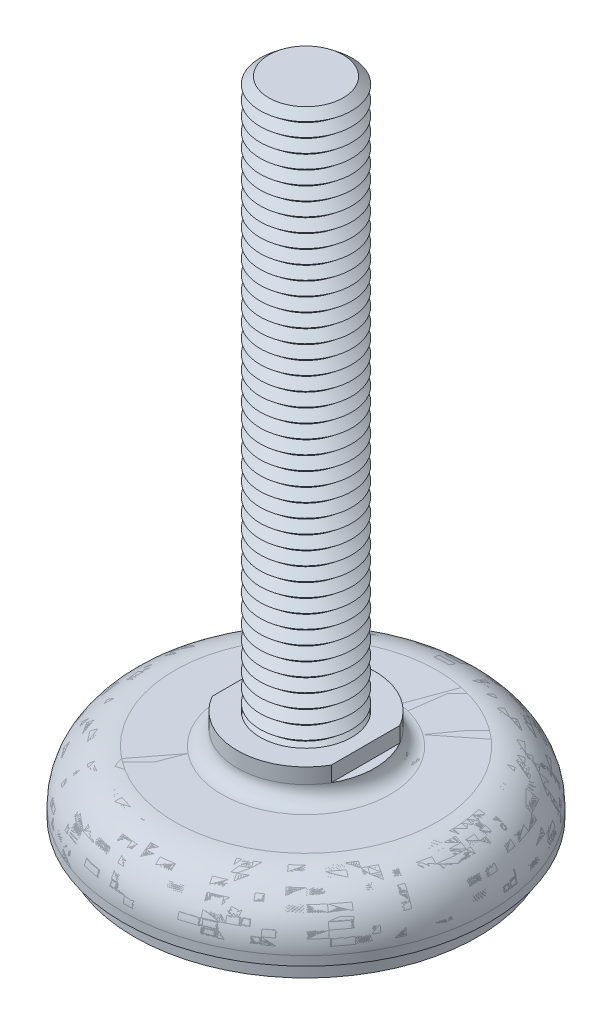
ISO-10303-21;
HEADER;
FILE_DESCRIPTION(('STEP AP214'),'2;1');
FILE_NAME('part.step','',(''),(''),'','','');
FILE_SCHEMA(('AUTOMOTIVE_DESIGN { 1 0 10303 214 1 1 1 1 }'));
ENDSEC;
DATA;
#1=APPLICATION_CONTEXT('core data for automotive mechanical design processes');
#2=APPLICATION_PROTOCOL_DEFINITION('international standard','automotive_design',2000,#1);
#3=PRODUCT_CONTEXT('',#1,'mechanical');
#4=PRODUCT('Part','Part','',(#3));
#5=PRODUCT_RELATED_PRODUCT_CATEGORY('part','',(#4));
#6=PRODUCT_DEFINITION_FORMATION('','',#4);
#7=PRODUCT_DEFINITION_CONTEXT('part definition',#1,'design');
#8=PRODUCT_DEFINITION('design','',#6,#7);
#9=PRODUCT_DEFINITION_SHAPE('','',#8);
#10=(LENGTH_UNIT() NAMED_UNIT(*) SI_UNIT(.MILLI.,.METRE.));
#11=(NAMED_UNIT(*) PLANE_ANGLE_UNIT() SI_UNIT($,.RADIAN.));
#12=(NAMED_UNIT(*) SI_UNIT($,.STERADIAN.) SOLID_ANGLE_UNIT());
#13=UNCERTAINTY_MEASURE_WITH_UNIT(LENGTH_MEASURE(1.E-05),#10,'distance_accuracy_value','');
#14=(GEOMETRIC_REPRESENTATION_CONTEXT(3) GLOBAL_UNCERTAINTY_ASSIGNED_CONTEXT((#13)) GLOBAL_UNIT_ASSIGNED_CONTEXT((#10,
#11,#12)) REPRESENTATION_CONTEXT('',''));
#15=CARTESIAN_POINT('',(0.,0.,0.));
#16=DIRECTION('',(0.,0.,1.));
#17=DIRECTION('',(1.,0.,0.));
#18=AXIS2_PLACEMENT_3D('',#15,#16,#17);
#19=CARTESIAN_POINT('',(0.,67.5,0.));
#20=DIRECTION('',(0.,-1.,0.));
#21=DIRECTION('',(0.998136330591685,0.,-0.0610234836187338));
#22=AXIS2_PLACEMENT_3D('',#19,#20,#21);
#23=CONICAL_SURFACE('',#22,4.06325030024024,0.895664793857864);
#24=CARTESIAN_POINT('',(0.,66.75,0.));
#25=DIRECTION('',(0.,-1.,0.));
#26=DIRECTION('',(0.998136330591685,0.,-0.0610234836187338));
#27=AXIS2_PLACEMENT_3D('',#24,#25,#26);
#28=CIRCLE('',#27,5.);
#29=CARTESIAN_POINT('',(4.99068165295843,66.75,-0.305117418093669));
#30=VERTEX_POINT('',#29);
#31=EDGE_CURVE('P0_E37',#30,#30,#28,.T.);
#32=ORIENTED_EDGE('',*,*,#31,.F.);
#33=EDGE_LOOP('',(#32));
#34=FACE_BOUND('',#33,.T.);
#35=CARTESIAN_POINT('',(0.,67.5,0.));
#36=DIRECTION('',(0.,-1.,0.));
#37=DIRECTION('',(0.998136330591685,0.,-0.0610234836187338));
#38=AXIS2_PLACEMENT_3D('',#35,#36,#37);
#39=CIRCLE('',#38,4.06325030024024);
#40=CARTESIAN_POINT('',(4.05567774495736,67.5,-0.247953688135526));
#41=VERTEX_POINT('',#40);
#42=EDGE_CURVE('P0_E25',#41,#41,#39,.T.);
#43=ORIENTED_EDGE('',*,*,#42,.T.);
#44=EDGE_LOOP('',(#43));
#45=FACE_BOUND('',#44,.T.);
#46=ADVANCED_FACE('P0_F14',(#34,#45),#23,.T.);
#47=CARTESIAN_POINT('',(0.,68.25,0.));
#48=DIRECTION('',(0.,1.,0.));
#49=DIRECTION('',(-0.998136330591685,0.,0.0610234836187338));
#50=AXIS2_PLACEMENT_3D('',#47,#48,#49);
#51=CONICAL_SURFACE('',#50,5.,0.895664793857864);
#52=ORIENTED_EDGE('',*,*,#42,.F.);
#53=EDGE_LOOP('',(#52));
#54=FACE_BOUND('',#53,.T.);
#55=CARTESIAN_POINT('',(0.,68.25,0.));
#56=DIRECTION('',(0.,-1.,0.));
#57=DIRECTION('',(0.998136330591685,0.,-0.0610234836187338));
#58=AXIS2_PLACEMENT_3D('',#55,#56,#57);
#59=CIRCLE('',#58,5.);
#60=CARTESIAN_POINT('',(4.99068165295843,68.25,-0.305117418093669));
#61=VERTEX_POINT('',#60);
#62=EDGE_CURVE('P0_E29',#61,#61,#59,.T.);
#63=ORIENTED_EDGE('',*,*,#62,.T.);
#64=EDGE_LOOP('',(#63));
#65=FACE_BOUND('',#64,.T.);
#66=ADVANCED_FACE('P0_F799',(#54,#65),#51,.T.);
#67=CARTESIAN_POINT('',(0.,69.,0.));
#68=DIRECTION('',(0.,1.,0.));
#69=DIRECTION('',(-0.998136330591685,0.,0.0610234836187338));
#70=AXIS2_PLACEMENT_3D('',#67,#68,#69);
#71=PLANE('',#70);
#72=CARTESIAN_POINT('',(0.,69.,0.));
#73=DIRECTION('',(0.,-1.,0.));
#74=DIRECTION('',(0.998136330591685,0.,-0.0610234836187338));
#75=AXIS2_PLACEMENT_3D('',#72,#73,#74);
#76=CIRCLE('',#75,4.06325030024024);
#77=CARTESIAN_POINT('',(4.05567774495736,69.,-0.247953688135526));
#78=VERTEX_POINT('',#77);
#79=EDGE_CURVE('P0_E21',#78,#78,#76,.T.);
#80=ORIENTED_EDGE('',*,*,#79,.F.);
#81=EDGE_LOOP('',(#80));
#82=FACE_BOUND('',#81,.T.);
#83=ADVANCED_FACE('P0_F805',(#82),#71,.T.);
#84=CARTESIAN_POINT('',(0.,69.,0.));
#85=DIRECTION('',(0.,-1.,0.));
#86=DIRECTION('',(0.998136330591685,0.,-0.0610234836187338));
#87=AXIS2_PLACEMENT_3D('',#84,#85,#86);
#88=CONICAL_SURFACE('',#87,4.06325030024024,0.895664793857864);
#89=ORIENTED_EDGE('',*,*,#62,.F.);
#90=EDGE_LOOP('',(#89));
#91=FACE_BOUND('',#90,.T.);
#92=ORIENTED_EDGE('',*,*,#79,.T.);
#93=EDGE_LOOP('',(#92));
#94=FACE_BOUND('',#93,.T.);
#95=ADVANCED_FACE('P0_F788',(#91,#94),#88,.T.);
#96=CARTESIAN_POINT('',(0.,66.,0.));
#97=DIRECTION('',(0.,-1.,0.));
#98=DIRECTION('',(0.998136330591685,0.,-0.0610234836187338));
#99=AXIS2_PLACEMENT_3D('',#96,#97,#98);
#100=CONICAL_SURFACE('',#99,4.06325030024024,0.895664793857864);
#101=CARTESIAN_POINT('',(0.,65.25,0.));
#102=DIRECTION('',(0.,-1.,0.));
#103=DIRECTION('',(0.998136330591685,0.,-0.0610234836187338));
#104=AXIS2_PLACEMENT_3D('',#101,#102,#103);
#105=CIRCLE('',#104,5.);
#106=CARTESIAN_POINT('',(4.99068165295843,65.25,-0.305117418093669));
#107=VERTEX_POINT('',#106);
#108=EDGE_CURVE('P0_E43',#107,#107,#105,.T.);
#109=ORIENTED_EDGE('',*,*,#108,.F.);
#110=EDGE_LOOP('',(#109));
#111=FACE_BOUND('',#110,.T.);
#112=CARTESIAN_POINT('',(0.,66.,0.));
#113=DIRECTION('',(0.,-1.,0.));
#114=DIRECTION('',(0.998136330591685,0.,-0.0610234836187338));
#115=AXIS2_PLACEMENT_3D('',#112,#113,#114);
#116=CIRCLE('',#115,4.06325030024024);
#117=CARTESIAN_POINT('',(4.05567774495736,66.,-0.247953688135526));
#118=VERTEX_POINT('',#117);
#119=EDGE_CURVE('P0_E34',#118,#118,#116,.T.);
#120=ORIENTED_EDGE('',*,*,#119,.T.);
#121=EDGE_LOOP('',(#120));
#122=FACE_BOUND('',#121,.T.);
#123=ADVANCED_FACE('P0_F785',(#111,#122),#100,.T.);
#124=CARTESIAN_POINT('',(0.,66.75,0.));
#125=DIRECTION('',(0.,1.,0.));
#126=DIRECTION('',(-0.998136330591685,0.,0.0610234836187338));
#127=AXIS2_PLACEMENT_3D('',#124,#125,#126);
#128=CONICAL_SURFACE('',#127,5.,0.895664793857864);
#129=ORIENTED_EDGE('',*,*,#119,.F.);
#130=EDGE_LOOP('',(#129));
#131=FACE_BOUND('',#130,.T.);
#132=ORIENTED_EDGE('',*,*,#31,.T.);
#133=EDGE_LOOP('',(#132));
#134=FACE_BOUND('',#133,.T.);
#135=ADVANCED_FACE('P0_F776',(#131,#134),#128,.T.);
#136=CARTESIAN_POINT('',(0.,64.5,0.));
#137=DIRECTION('',(0.,-1.,0.));
#138=DIRECTION('',(0.998136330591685,0.,-0.0610234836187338));
#139=AXIS2_PLACEMENT_3D('',#136,#137,#138);
#140=CONICAL_SURFACE('',#139,4.06325030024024,0.895664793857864);
#141=CARTESIAN_POINT('',(0.,63.75,0.));
#142=DIRECTION('',(0.,-1.,0.));
#143=DIRECTION('',(0.998136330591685,0.,-0.0610234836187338));
#144=AXIS2_PLACEMENT_3D('',#141,#142,#143);
#145=CIRCLE('',#144,5.);
#146=CARTESIAN_POINT('',(4.99068165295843,63.75,-0.305117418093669));
#147=VERTEX_POINT('',#146);
#148=EDGE_CURVE('P0_E49',#147,#147,#145,.T.);
#149=ORIENTED_EDGE('',*,*,#148,.F.);
#150=EDGE_LOOP('',(#149));
#151=FACE_BOUND('',#150,.T.);
#152=CARTESIAN_POINT('',(0.,64.5,0.));
#153=DIRECTION('',(0.,-1.,0.));
#154=DIRECTION('',(0.998136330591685,0.,-0.0610234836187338));
#155=AXIS2_PLACEMENT_3D('',#152,#153,#154);
#156=CIRCLE('',#155,4.06325030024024);
#157=CARTESIAN_POINT('',(4.05567774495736,64.5,-0.247953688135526));
#158=VERTEX_POINT('',#157);
#159=EDGE_CURVE('P0_E40',#158,#158,#156,.T.);
#160=ORIENTED_EDGE('',*,*,#159,.T.);
#161=EDGE_LOOP('',(#160));
#162=FACE_BOUND('',#161,.T.);
#163=ADVANCED_FACE('P0_F773',(#151,#162),#140,.T.);
#164=CARTESIAN_POINT('',(0.,65.25,0.));
#165=DIRECTION('',(0.,1.,0.));
#166=DIRECTION('',(-0.998136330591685,0.,0.0610234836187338));
#167=AXIS2_PLACEMENT_3D('',#164,#165,#166);
#168=CONICAL_SURFACE('',#167,5.,0.895664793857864);
#169=ORIENTED_EDGE('',*,*,#159,.F.);
#170=EDGE_LOOP('',(#169));
#171=FACE_BOUND('',#170,.T.);
#172=ORIENTED_EDGE('',*,*,#108,.T.);
#173=EDGE_LOOP('',(#172));
#174=FACE_BOUND('',#173,.T.);
#175=ADVANCED_FACE('P0_F764',(#171,#174),#168,.T.);
#176=CARTESIAN_POINT('',(0.,63.,0.));
#177=DIRECTION('',(0.,-1.,0.));
#178=DIRECTION('',(0.998136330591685,0.,-0.0610234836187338));
#179=AXIS2_PLACEMENT_3D('',#176,#177,#178);
#180=CONICAL_SURFACE('',#179,4.06325030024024,0.895664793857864);
#181=CARTESIAN_POINT('',(0.,62.25,0.));
#182=DIRECTION('',(0.,-1.,0.));
#183=DIRECTION('',(0.998136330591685,0.,-0.0610234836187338));
#184=AXIS2_PLACEMENT_3D('',#181,#182,#183);
#185=CIRCLE('',#184,5.);
#186=CARTESIAN_POINT('',(4.99068165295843,62.25,-0.305117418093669));
#187=VERTEX_POINT('',#186);
#188=EDGE_CURVE('P0_E55',#187,#187,#185,.T.);
#189=ORIENTED_EDGE('',*,*,#188,.F.);
#190=EDGE_LOOP('',(#189));
#191=FACE_BOUND('',#190,.T.);
#192=CARTESIAN_POINT('',(0.,63.,0.));
#193=DIRECTION('',(0.,-1.,0.));
#194=DIRECTION('',(0.998136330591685,0.,-0.0610234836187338));
#195=AXIS2_PLACEMENT_3D('',#192,#193,#194);
#196=CIRCLE('',#195,4.06325030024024);
#197=CARTESIAN_POINT('',(4.05567774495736,63.,-0.247953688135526));
#198=VERTEX_POINT('',#197);
#199=EDGE_CURVE('P0_E46',#198,#198,#196,.T.);
#200=ORIENTED_EDGE('',*,*,#199,.T.);
#201=EDGE_LOOP('',(#200));
#202=FACE_BOUND('',#201,.T.);
#203=ADVANCED_FACE('P0_F761',(#191,#202),#180,.T.);
#204=CARTESIAN_POINT('',(0.,63.75,0.));
#205=DIRECTION('',(0.,1.,0.));
#206=DIRECTION('',(-0.998136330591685,0.,0.0610234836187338));
#207=AXIS2_PLACEMENT_3D('',#204,#205,#206);
#208=CONICAL_SURFACE('',#207,5.,0.895664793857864);
#209=ORIENTED_EDGE('',*,*,#199,.F.);
#210=EDGE_LOOP('',(#209));
#211=FACE_BOUND('',#210,.T.);
#212=ORIENTED_EDGE('',*,*,#148,.T.);
#213=EDGE_LOOP('',(#212));
#214=FACE_BOUND('',#213,.T.);
#215=ADVANCED_FACE('P0_F752',(#211,#214),#208,.T.);
#216=CARTESIAN_POINT('',(0.,61.5,0.));
#217=DIRECTION('',(0.,-1.,0.));
#218=DIRECTION('',(0.998136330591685,0.,-0.0610234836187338));
#219=AXIS2_PLACEMENT_3D('',#216,#217,#218);
#220=CONICAL_SURFACE('',#219,4.06325030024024,0.895664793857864);
#221=CARTESIAN_POINT('',(0.,60.75,0.));
#222=DIRECTION('',(0.,-1.,0.));
#223=DIRECTION('',(0.998136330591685,0.,-0.0610234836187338));
#224=AXIS2_PLACEMENT_3D('',#221,#222,#223);
#225=CIRCLE('',#224,5.);
#226=CARTESIAN_POINT('',(4.99068165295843,60.75,-0.305117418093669));
#227=VERTEX_POINT('',#226);
#228=EDGE_CURVE('P0_E61',#227,#227,#225,.T.);
#229=ORIENTED_EDGE('',*,*,#228,.F.);
#230=EDGE_LOOP('',(#229));
#231=FACE_BOUND('',#230,.T.);
#232=CARTESIAN_POINT('',(0.,61.5,0.));
#233=DIRECTION('',(0.,-1.,0.));
#234=DIRECTION('',(0.998136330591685,0.,-0.0610234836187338));
#235=AXIS2_PLACEMENT_3D('',#232,#233,#234);
#236=CIRCLE('',#235,4.06325030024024);
#237=CARTESIAN_POINT('',(4.05567774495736,61.5,-0.247953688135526));
#238=VERTEX_POINT('',#237);
#239=EDGE_CURVE('P0_E52',#238,#238,#236,.T.);
#240=ORIENTED_EDGE('',*,*,#239,.T.);
#241=EDGE_LOOP('',(#240));
#242=FACE_BOUND('',#241,.T.);
#243=ADVANCED_FACE('P0_F749',(#231,#242),#220,.T.);
#244=CARTESIAN_POINT('',(0.,62.25,0.));
#245=DIRECTION('',(0.,1.,0.));
#246=DIRECTION('',(-0.998136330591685,0.,0.0610234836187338));
#247=AXIS2_PLACEMENT_3D('',#244,#245,#246);
#248=CONICAL_SURFACE('',#247,5.,0.895664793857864);
#249=ORIENTED_EDGE('',*,*,#239,.F.);
#250=EDGE_LOOP('',(#249));
#251=FACE_BOUND('',#250,.T.);
#252=ORIENTED_EDGE('',*,*,#188,.T.);
#253=EDGE_LOOP('',(#252));
#254=FACE_BOUND('',#253,.T.);
#255=ADVANCED_FACE('P0_F740',(#251,#254),#248,.T.);
#256=CARTESIAN_POINT('',(0.,60.,0.));
#257=DIRECTION('',(0.,-1.,0.));
#258=DIRECTION('',(0.998136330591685,0.,-0.0610234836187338));
#259=AXIS2_PLACEMENT_3D('',#256,#257,#258);
#260=CONICAL_SURFACE('',#259,4.06325030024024,0.895664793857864);
#261=CARTESIAN_POINT('',(0.,59.25,0.));
#262=DIRECTION('',(0.,-1.,0.));
#263=DIRECTION('',(0.998136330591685,0.,-0.0610234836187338));
#264=AXIS2_PLACEMENT_3D('',#261,#262,#263);
#265=CIRCLE('',#264,5.);
#266=CARTESIAN_POINT('',(4.99068165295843,59.25,-0.305117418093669));
#267=VERTEX_POINT('',#266);
#268=EDGE_CURVE('P0_E67',#267,#267,#265,.T.);
#269=ORIENTED_EDGE('',*,*,#268,.F.);
#270=EDGE_LOOP('',(#269));
#271=FACE_BOUND('',#270,.T.);
#272=CARTESIAN_POINT('',(0.,60.,0.));
#273=DIRECTION('',(0.,-1.,0.));
#274=DIRECTION('',(0.998136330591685,0.,-0.0610234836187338));
#275=AXIS2_PLACEMENT_3D('',#272,#273,#274);
#276=CIRCLE('',#275,4.06325030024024);
#277=CARTESIAN_POINT('',(4.05567774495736,60.,-0.247953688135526));
#278=VERTEX_POINT('',#277);
#279=EDGE_CURVE('P0_E58',#278,#278,#276,.T.);
#280=ORIENTED_EDGE('',*,*,#279,.T.);
#281=EDGE_LOOP('',(#280));
#282=FACE_BOUND('',#281,.T.);
#283=ADVANCED_FACE('P0_F737',(#271,#282),#260,.T.);
#284=CARTESIAN_POINT('',(0.,60.75,0.));
#285=DIRECTION('',(0.,1.,0.));
#286=DIRECTION('',(-0.998136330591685,0.,0.0610234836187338));
#287=AXIS2_PLACEMENT_3D('',#284,#285,#286);
#288=CONICAL_SURFACE('',#287,5.,0.895664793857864);
#289=ORIENTED_EDGE('',*,*,#279,.F.);
#290=EDGE_LOOP('',(#289));
#291=FACE_BOUND('',#290,.T.);
#292=ORIENTED_EDGE('',*,*,#228,.T.);
#293=EDGE_LOOP('',(#292));
#294=FACE_BOUND('',#293,.T.);
#295=ADVANCED_FACE('P0_F728',(#291,#294),#288,.T.);
#296=CARTESIAN_POINT('',(0.,58.5,0.));
#297=DIRECTION('',(0.,-1.,0.));
#298=DIRECTION('',(0.998136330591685,0.,-0.0610234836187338));
#299=AXIS2_PLACEMENT_3D('',#296,#297,#298);
#300=CONICAL_SURFACE('',#299,4.06325030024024,0.895664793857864);
#301=CARTESIAN_POINT('',(0.,57.75,0.));
#302=DIRECTION('',(0.,-1.,0.));
#303=DIRECTION('',(0.998136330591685,0.,-0.0610234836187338));
#304=AXIS2_PLACEMENT_3D('',#301,#302,#303);
#305=CIRCLE('',#304,5.);
#306=CARTESIAN_POINT('',(4.99068165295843,57.75,-0.305117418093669));
#307=VERTEX_POINT('',#306);
#308=EDGE_CURVE('P0_E73',#307,#307,#305,.T.);
#309=ORIENTED_EDGE('',*,*,#308,.F.);
#310=EDGE_LOOP('',(#309));
#311=FACE_BOUND('',#310,.T.);
#312=CARTESIAN_POINT('',(0.,58.5,0.));
#313=DIRECTION('',(0.,-1.,0.));
#314=DIRECTION('',(0.998136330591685,0.,-0.0610234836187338));
#315=AXIS2_PLACEMENT_3D('',#312,#313,#314);
#316=CIRCLE('',#315,4.06325030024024);
#317=CARTESIAN_POINT('',(4.05567774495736,58.5,-0.247953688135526));
#318=VERTEX_POINT('',#317);
#319=EDGE_CURVE('P0_E64',#318,#318,#316,.T.);
#320=ORIENTED_EDGE('',*,*,#319,.T.);
#321=EDGE_LOOP('',(#320));
#322=FACE_BOUND('',#321,.T.);
#323=ADVANCED_FACE('P0_F725',(#311,#322),#300,.T.);
#324=CARTESIAN_POINT('',(0.,59.25,0.));
#325=DIRECTION('',(0.,1.,0.));
#326=DIRECTION('',(-0.998136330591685,0.,0.0610234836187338));
#327=AXIS2_PLACEMENT_3D('',#324,#325,#326);
#328=CONICAL_SURFACE('',#327,5.,0.895664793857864);
#329=ORIENTED_EDGE('',*,*,#319,.F.);
#330=EDGE_LOOP('',(#329));
#331=FACE_BOUND('',#330,.T.);
#332=ORIENTED_EDGE('',*,*,#268,.T.);
#333=EDGE_LOOP('',(#332));
#334=FACE_BOUND('',#333,.T.);
#335=ADVANCED_FACE('P0_F716',(#331,#334),#328,.T.);
#336=CARTESIAN_POINT('',(0.,57.,0.));
#337=DIRECTION('',(0.,-1.,0.));
#338=DIRECTION('',(0.998136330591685,0.,-0.0610234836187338));
#339=AXIS2_PLACEMENT_3D('',#336,#337,#338);
#340=CONICAL_SURFACE('',#339,4.06325030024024,0.895664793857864);
#341=CARTESIAN_POINT('',(0.,56.25,0.));
#342=DIRECTION('',(0.,-1.,0.));
#343=DIRECTION('',(0.998136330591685,0.,-0.0610234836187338));
#344=AXIS2_PLACEMENT_3D('',#341,#342,#343);
#345=CIRCLE('',#344,5.);
#346=CARTESIAN_POINT('',(4.99068165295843,56.25,-0.305117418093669));
#347=VERTEX_POINT('',#346);
#348=EDGE_CURVE('P0_E79',#347,#347,#345,.T.);
#349=ORIENTED_EDGE('',*,*,#348,.F.);
#350=EDGE_LOOP('',(#349));
#351=FACE_BOUND('',#350,.T.);
#352=CARTESIAN_POINT('',(0.,57.,0.));
#353=DIRECTION('',(0.,-1.,0.));
#354=DIRECTION('',(0.998136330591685,0.,-0.0610234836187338));
#355=AXIS2_PLACEMENT_3D('',#352,#353,#354);
#356=CIRCLE('',#355,4.06325030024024);
#357=CARTESIAN_POINT('',(4.05567774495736,57.,-0.247953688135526));
#358=VERTEX_POINT('',#357);
#359=EDGE_CURVE('P0_E70',#358,#358,#356,.T.);
#360=ORIENTED_EDGE('',*,*,#359,.T.);
#361=EDGE_LOOP('',(#360));
#362=FACE_BOUND('',#361,.T.);
#363=ADVANCED_FACE('P0_F713',(#351,#362),#340,.T.);
#364=CARTESIAN_POINT('',(0.,57.75,0.));
#365=DIRECTION('',(0.,1.,0.));
#366=DIRECTION('',(-0.998136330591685,0.,0.0610234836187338));
#367=AXIS2_PLACEMENT_3D('',#364,#365,#366);
#368=CONICAL_SURFACE('',#367,5.,0.895664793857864);
#369=ORIENTED_EDGE('',*,*,#359,.F.);
#370=EDGE_LOOP('',(#369));
#371=FACE_BOUND('',#370,.T.);
#372=ORIENTED_EDGE('',*,*,#308,.T.);
#373=EDGE_LOOP('',(#372));
#374=FACE_BOUND('',#373,.T.);
#375=ADVANCED_FACE('P0_F704',(#371,#374),#368,.T.);
#376=CARTESIAN_POINT('',(0.,55.5,0.));
#377=DIRECTION('',(0.,-1.,0.));
#378=DIRECTION('',(0.998136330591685,0.,-0.0610234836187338));
#379=AXIS2_PLACEMENT_3D('',#376,#377,#378);
#380=CONICAL_SURFACE('',#379,4.06325030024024,0.895664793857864);
#381=CARTESIAN_POINT('',(0.,54.75,0.));
#382=DIRECTION('',(0.,-1.,0.));
#383=DIRECTION('',(0.998136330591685,0.,-0.0610234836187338));
#384=AXIS2_PLACEMENT_3D('',#381,#382,#383);
#385=CIRCLE('',#384,5.);
#386=CARTESIAN_POINT('',(4.99068165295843,54.75,-0.305117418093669));
#387=VERTEX_POINT('',#386);
#388=EDGE_CURVE('P0_E85',#387,#387,#385,.T.);
#389=ORIENTED_EDGE('',*,*,#388,.F.);
#390=EDGE_LOOP('',(#389));
#391=FACE_BOUND('',#390,.T.);
#392=CARTESIAN_POINT('',(0.,55.5,0.));
#393=DIRECTION('',(0.,-1.,0.));
#394=DIRECTION('',(0.998136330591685,0.,-0.0610234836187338));
#395=AXIS2_PLACEMENT_3D('',#392,#393,#394);
#396=CIRCLE('',#395,4.06325030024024);
#397=CARTESIAN_POINT('',(4.05567774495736,55.5,-0.247953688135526));
#398=VERTEX_POINT('',#397);
#399=EDGE_CURVE('P0_E76',#398,#398,#396,.T.);
#400=ORIENTED_EDGE('',*,*,#399,.T.);
#401=EDGE_LOOP('',(#400));
#402=FACE_BOUND('',#401,.T.);
#403=ADVANCED_FACE('P0_F701',(#391,#402),#380,.T.);
#404=CARTESIAN_POINT('',(0.,56.25,0.));
#405=DIRECTION('',(0.,1.,0.));
#406=DIRECTION('',(-0.998136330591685,0.,0.0610234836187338));
#407=AXIS2_PLACEMENT_3D('',#404,#405,#406);
#408=CONICAL_SURFACE('',#407,5.,0.895664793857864);
#409=ORIENTED_EDGE('',*,*,#399,.F.);
#410=EDGE_LOOP('',(#409));
#411=FACE_BOUND('',#410,.T.);
#412=ORIENTED_EDGE('',*,*,#348,.T.);
#413=EDGE_LOOP('',(#412));
#414=FACE_BOUND('',#413,.T.);
#415=ADVANCED_FACE('P0_F692',(#411,#414),#408,.T.);
#416=CARTESIAN_POINT('',(0.,54.,0.));
#417=DIRECTION('',(0.,-1.,0.));
#418=DIRECTION('',(0.998136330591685,0.,-0.0610234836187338));
#419=AXIS2_PLACEMENT_3D('',#416,#417,#418);
#420=CONICAL_SURFACE('',#419,4.06325030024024,0.895664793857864);
#421=CARTESIAN_POINT('',(0.,53.25,0.));
#422=DIRECTION('',(0.,-1.,0.));
#423=DIRECTION('',(0.998136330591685,0.,-0.0610234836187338));
#424=AXIS2_PLACEMENT_3D('',#421,#422,#423);
#425=CIRCLE('',#424,5.);
#426=CARTESIAN_POINT('',(4.99068165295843,53.25,-0.305117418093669));
#427=VERTEX_POINT('',#426);
#428=EDGE_CURVE('P0_E91',#427,#427,#425,.T.);
#429=ORIENTED_EDGE('',*,*,#428,.F.);
#430=EDGE_LOOP('',(#429));
#431=FACE_BOUND('',#430,.T.);
#432=CARTESIAN_POINT('',(0.,54.,0.));
#433=DIRECTION('',(0.,-1.,0.));
#434=DIRECTION('',(0.998136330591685,0.,-0.0610234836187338));
#435=AXIS2_PLACEMENT_3D('',#432,#433,#434);
#436=CIRCLE('',#435,4.06325030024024);
#437=CARTESIAN_POINT('',(4.05567774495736,54.,-0.247953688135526));
#438=VERTEX_POINT('',#437);
#439=EDGE_CURVE('P0_E82',#438,#438,#436,.T.);
#440=ORIENTED_EDGE('',*,*,#439,.T.);
#441=EDGE_LOOP('',(#440));
#442=FACE_BOUND('',#441,.T.);
#443=ADVANCED_FACE('P0_F689',(#431,#442),#420,.T.);
#444=CARTESIAN_POINT('',(0.,54.75,0.));
#445=DIRECTION('',(0.,1.,0.));
#446=DIRECTION('',(-0.998136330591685,0.,0.0610234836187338));
#447=AXIS2_PLACEMENT_3D('',#444,#445,#446);
#448=CONICAL_SURFACE('',#447,5.,0.895664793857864);
#449=ORIENTED_EDGE('',*,*,#439,.F.);
#450=EDGE_LOOP('',(#449));
#451=FACE_BOUND('',#450,.T.);
#452=ORIENTED_EDGE('',*,*,#388,.T.);
#453=EDGE_LOOP('',(#452));
#454=FACE_BOUND('',#453,.T.);
#455=ADVANCED_FACE('P0_F680',(#451,#454),#448,.T.);
#456=CARTESIAN_POINT('',(0.,52.5,0.));
#457=DIRECTION('',(0.,-1.,0.));
#458=DIRECTION('',(0.998136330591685,0.,-0.0610234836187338));
#459=AXIS2_PLACEMENT_3D('',#456,#457,#458);
#460=CONICAL_SURFACE('',#459,4.06325030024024,0.895664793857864);
#461=CARTESIAN_POINT('',(0.,51.75,0.));
#462=DIRECTION('',(0.,-1.,0.));
#463=DIRECTION('',(0.998136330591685,0.,-0.0610234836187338));
#464=AXIS2_PLACEMENT_3D('',#461,#462,#463);
#465=CIRCLE('',#464,5.);
#466=CARTESIAN_POINT('',(4.99068165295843,51.75,-0.305117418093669));
#467=VERTEX_POINT('',#466);
#468=EDGE_CURVE('P0_E97',#467,#467,#465,.T.);
#469=ORIENTED_EDGE('',*,*,#468,.F.);
#470=EDGE_LOOP('',(#469));
#471=FACE_BOUND('',#470,.T.);
#472=CARTESIAN_POINT('',(0.,52.5,0.));
#473=DIRECTION('',(0.,-1.,0.));
#474=DIRECTION('',(0.998136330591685,0.,-0.0610234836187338));
#475=AXIS2_PLACEMENT_3D('',#472,#473,#474);
#476=CIRCLE('',#475,4.06325030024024);
#477=CARTESIAN_POINT('',(4.05567774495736,52.5,-0.247953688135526));
#478=VERTEX_POINT('',#477);
#479=EDGE_CURVE('P0_E88',#478,#478,#476,.T.);
#480=ORIENTED_EDGE('',*,*,#479,.T.);
#481=EDGE_LOOP('',(#480));
#482=FACE_BOUND('',#481,.T.);
#483=ADVANCED_FACE('P0_F677',(#471,#482),#460,.T.);
#484=CARTESIAN_POINT('',(0.,53.25,0.));
#485=DIRECTION('',(0.,1.,0.));
#486=DIRECTION('',(-0.998136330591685,0.,0.0610234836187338));
#487=AXIS2_PLACEMENT_3D('',#484,#485,#486);
#488=CONICAL_SURFACE('',#487,5.,0.895664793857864);
#489=ORIENTED_EDGE('',*,*,#479,.F.);
#490=EDGE_LOOP('',(#489));
#491=FACE_BOUND('',#490,.T.);
#492=ORIENTED_EDGE('',*,*,#428,.T.);
#493=EDGE_LOOP('',(#492));
#494=FACE_BOUND('',#493,.T.);
#495=ADVANCED_FACE('P0_F668',(#491,#494),#488,.T.);
#496=CARTESIAN_POINT('',(0.,51.,0.));
#497=DIRECTION('',(0.,-1.,0.));
#498=DIRECTION('',(0.998136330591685,0.,-0.0610234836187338));
#499=AXIS2_PLACEMENT_3D('',#496,#497,#498);
#500=CONICAL_SURFACE('',#499,4.06325030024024,0.895664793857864);
#501=CARTESIAN_POINT('',(0.,50.25,0.));
#502=DIRECTION('',(0.,-1.,0.));
#503=DIRECTION('',(0.998136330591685,0.,-0.0610234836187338));
#504=AXIS2_PLACEMENT_3D('',#501,#502,#503);
#505=CIRCLE('',#504,5.);
#506=CARTESIAN_POINT('',(4.99068165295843,50.25,-0.305117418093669));
#507=VERTEX_POINT('',#506);
#508=EDGE_CURVE('P0_E103',#507,#507,#505,.T.);
#509=ORIENTED_EDGE('',*,*,#508,.F.);
#510=EDGE_LOOP('',(#509));
#511=FACE_BOUND('',#510,.T.);
#512=CARTESIAN_POINT('',(0.,51.,0.));
#513=DIRECTION('',(0.,-1.,0.));
#514=DIRECTION('',(0.998136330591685,0.,-0.0610234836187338));
#515=AXIS2_PLACEMENT_3D('',#512,#513,#514);
#516=CIRCLE('',#515,4.06325030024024);
#517=CARTESIAN_POINT('',(4.05567774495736,51.,-0.247953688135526));
#518=VERTEX_POINT('',#517);
#519=EDGE_CURVE('P0_E94',#518,#518,#516,.T.);
#520=ORIENTED_EDGE('',*,*,#519,.T.);
#521=EDGE_LOOP('',(#520));
#522=FACE_BOUND('',#521,.T.);
#523=ADVANCED_FACE('P0_F665',(#511,#522),#500,.T.);
#524=CARTESIAN_POINT('',(0.,51.75,0.));
#525=DIRECTION('',(0.,1.,0.));
#526=DIRECTION('',(-0.998136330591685,0.,0.0610234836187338));
#527=AXIS2_PLACEMENT_3D('',#524,#525,#526);
#528=CONICAL_SURFACE('',#527,5.,0.895664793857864);
#529=ORIENTED_EDGE('',*,*,#519,.F.);
#530=EDGE_LOOP('',(#529));
#531=FACE_BOUND('',#530,.T.);
#532=ORIENTED_EDGE('',*,*,#468,.T.);
#533=EDGE_LOOP('',(#532));
#534=FACE_BOUND('',#533,.T.);
#535=ADVANCED_FACE('P0_F656',(#531,#534),#528,.T.);
#536=CARTESIAN_POINT('',(0.,49.5,0.));
#537=DIRECTION('',(0.,-1.,0.));
#538=DIRECTION('',(0.998136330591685,0.,-0.0610234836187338));
#539=AXIS2_PLACEMENT_3D('',#536,#537,#538);
#540=CONICAL_SURFACE('',#539,4.06325030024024,0.895664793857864);
#541=CARTESIAN_POINT('',(0.,48.75,0.));
#542=DIRECTION('',(0.,-1.,0.));
#543=DIRECTION('',(0.998136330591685,0.,-0.0610234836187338));
#544=AXIS2_PLACEMENT_3D('',#541,#542,#543);
#545=CIRCLE('',#544,5.);
#546=CARTESIAN_POINT('',(4.99068165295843,48.75,-0.305117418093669));
#547=VERTEX_POINT('',#546);
#548=EDGE_CURVE('P0_E109',#547,#547,#545,.T.);
#549=ORIENTED_EDGE('',*,*,#548,.F.);
#550=EDGE_LOOP('',(#549));
#551=FACE_BOUND('',#550,.T.);
#552=CARTESIAN_POINT('',(0.,49.5,0.));
#553=DIRECTION('',(0.,-1.,0.));
#554=DIRECTION('',(0.998136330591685,0.,-0.0610234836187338));
#555=AXIS2_PLACEMENT_3D('',#552,#553,#554);
#556=CIRCLE('',#555,4.06325030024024);
#557=CARTESIAN_POINT('',(4.05567774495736,49.5,-0.247953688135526));
#558=VERTEX_POINT('',#557);
#559=EDGE_CURVE('P0_E100',#558,#558,#556,.T.);
#560=ORIENTED_EDGE('',*,*,#559,.T.);
#561=EDGE_LOOP('',(#560));
#562=FACE_BOUND('',#561,.T.);
#563=ADVANCED_FACE('P0_F653',(#551,#562),#540,.T.);
#564=CARTESIAN_POINT('',(0.,50.25,0.));
#565=DIRECTION('',(0.,1.,0.));
#566=DIRECTION('',(-0.998136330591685,0.,0.0610234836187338));
#567=AXIS2_PLACEMENT_3D('',#564,#565,#566);
#568=CONICAL_SURFACE('',#567,5.,0.895664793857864);
#569=ORIENTED_EDGE('',*,*,#559,.F.);
#570=EDGE_LOOP('',(#569));
#571=FACE_BOUND('',#570,.T.);
#572=ORIENTED_EDGE('',*,*,#508,.T.);
#573=EDGE_LOOP('',(#572));
#574=FACE_BOUND('',#573,.T.);
#575=ADVANCED_FACE('P0_F644',(#571,#574),#568,.T.);
#576=CARTESIAN_POINT('',(0.,48.,0.));
#577=DIRECTION('',(0.,-1.,0.));
#578=DIRECTION('',(0.998136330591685,0.,-0.0610234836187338));
#579=AXIS2_PLACEMENT_3D('',#576,#577,#578);
#580=CONICAL_SURFACE('',#579,4.06325030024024,0.895664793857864);
#581=CARTESIAN_POINT('',(0.,47.25,0.));
#582=DIRECTION('',(0.,-1.,0.));
#583=DIRECTION('',(0.998136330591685,0.,-0.0610234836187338));
#584=AXIS2_PLACEMENT_3D('',#581,#582,#583);
#585=CIRCLE('',#584,5.);
#586=CARTESIAN_POINT('',(4.99068165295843,47.25,-0.305117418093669));
#587=VERTEX_POINT('',#586);
#588=EDGE_CURVE('P0_E115',#587,#587,#585,.T.);
#589=ORIENTED_EDGE('',*,*,#588,.F.);
#590=EDGE_LOOP('',(#589));
#591=FACE_BOUND('',#590,.T.);
#592=CARTESIAN_POINT('',(0.,48.,0.));
#593=DIRECTION('',(0.,-1.,0.));
#594=DIRECTION('',(0.998136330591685,0.,-0.0610234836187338));
#595=AXIS2_PLACEMENT_3D('',#592,#593,#594);
#596=CIRCLE('',#595,4.06325030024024);
#597=CARTESIAN_POINT('',(4.05567774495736,48.,-0.247953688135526));
#598=VERTEX_POINT('',#597);
#599=EDGE_CURVE('P0_E106',#598,#598,#596,.T.);
#600=ORIENTED_EDGE('',*,*,#599,.T.);
#601=EDGE_LOOP('',(#600));
#602=FACE_BOUND('',#601,.T.);
#603=ADVANCED_FACE('P0_F641',(#591,#602),#580,.T.);
#604=CARTESIAN_POINT('',(0.,48.75,0.));
#605=DIRECTION('',(0.,1.,0.));
#606=DIRECTION('',(-0.998136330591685,0.,0.0610234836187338));
#607=AXIS2_PLACEMENT_3D('',#604,#605,#606);
#608=CONICAL_SURFACE('',#607,5.,0.895664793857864);
#609=ORIENTED_EDGE('',*,*,#599,.F.);
#610=EDGE_LOOP('',(#609));
#611=FACE_BOUND('',#610,.T.);
#612=ORIENTED_EDGE('',*,*,#548,.T.);
#613=EDGE_LOOP('',(#612));
#614=FACE_BOUND('',#613,.T.);
#615=ADVANCED_FACE('P0_F632',(#611,#614),#608,.T.);
#616=CARTESIAN_POINT('',(0.,46.5,0.));
#617=DIRECTION('',(0.,-1.,0.));
#618=DIRECTION('',(0.998136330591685,0.,-0.0610234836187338));
#619=AXIS2_PLACEMENT_3D('',#616,#617,#618);
#620=CONICAL_SURFACE('',#619,4.06325030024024,0.895664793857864);
#621=CARTESIAN_POINT('',(0.,45.75,0.));
#622=DIRECTION('',(0.,-1.,0.));
#623=DIRECTION('',(0.998136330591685,0.,-0.0610234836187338));
#624=AXIS2_PLACEMENT_3D('',#621,#622,#623);
#625=CIRCLE('',#624,5.);
#626=CARTESIAN_POINT('',(4.99068165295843,45.75,-0.305117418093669));
#627=VERTEX_POINT('',#626);
#628=EDGE_CURVE('P0_E121',#627,#627,#625,.T.);
#629=ORIENTED_EDGE('',*,*,#628,.F.);
#630=EDGE_LOOP('',(#629));
#631=FACE_BOUND('',#630,.T.);
#632=CARTESIAN_POINT('',(0.,46.5,0.));
#633=DIRECTION('',(0.,-1.,0.));
#634=DIRECTION('',(0.998136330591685,0.,-0.0610234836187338));
#635=AXIS2_PLACEMENT_3D('',#632,#633,#634);
#636=CIRCLE('',#635,4.06325030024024);
#637=CARTESIAN_POINT('',(4.05567774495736,46.5,-0.247953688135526));
#638=VERTEX_POINT('',#637);
#639=EDGE_CURVE('P0_E112',#638,#638,#636,.T.);
#640=ORIENTED_EDGE('',*,*,#639,.T.);
#641=EDGE_LOOP('',(#640));
#642=FACE_BOUND('',#641,.T.);
#643=ADVANCED_FACE('P0_F629',(#631,#642),#620,.T.);
#644=CARTESIAN_POINT('',(0.,47.25,0.));
#645=DIRECTION('',(0.,1.,0.));
#646=DIRECTION('',(-0.998136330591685,0.,0.0610234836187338));
#647=AXIS2_PLACEMENT_3D('',#644,#645,#646);
#648=CONICAL_SURFACE('',#647,5.,0.895664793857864);
#649=ORIENTED_EDGE('',*,*,#639,.F.);
#650=EDGE_LOOP('',(#649));
#651=FACE_BOUND('',#650,.T.);
#652=ORIENTED_EDGE('',*,*,#588,.T.);
#653=EDGE_LOOP('',(#652));
#654=FACE_BOUND('',#653,.T.);
#655=ADVANCED_FACE('P0_F620',(#651,#654),#648,.T.);
#656=CARTESIAN_POINT('',(0.,45.,0.));
#657=DIRECTION('',(0.,-1.,0.));
#658=DIRECTION('',(0.998136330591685,0.,-0.0610234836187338));
#659=AXIS2_PLACEMENT_3D('',#656,#657,#658);
#660=CONICAL_SURFACE('',#659,4.06325030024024,0.895664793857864);
#661=CARTESIAN_POINT('',(0.,44.25,0.));
#662=DIRECTION('',(0.,-1.,0.));
#663=DIRECTION('',(0.998136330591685,0.,-0.0610234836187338));
#664=AXIS2_PLACEMENT_3D('',#661,#662,#663);
#665=CIRCLE('',#664,5.);
#666=CARTESIAN_POINT('',(4.99068165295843,44.25,-0.305117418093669));
#667=VERTEX_POINT('',#666);
#668=EDGE_CURVE('P0_E127',#667,#667,#665,.T.);
#669=ORIENTED_EDGE('',*,*,#668,.F.);
#670=EDGE_LOOP('',(#669));
#671=FACE_BOUND('',#670,.T.);
#672=CARTESIAN_POINT('',(0.,45.,0.));
#673=DIRECTION('',(0.,-1.,0.));
#674=DIRECTION('',(0.998136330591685,0.,-0.0610234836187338));
#675=AXIS2_PLACEMENT_3D('',#672,#673,#674);
#676=CIRCLE('',#675,4.06325030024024);
#677=CARTESIAN_POINT('',(4.05567774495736,45.,-0.247953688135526));
#678=VERTEX_POINT('',#677);
#679=EDGE_CURVE('P0_E118',#678,#678,#676,.T.);
#680=ORIENTED_EDGE('',*,*,#679,.T.);
#681=EDGE_LOOP('',(#680));
#682=FACE_BOUND('',#681,.T.);
#683=ADVANCED_FACE('P0_F617',(#671,#682),#660,.T.);
#684=CARTESIAN_POINT('',(0.,45.75,0.));
#685=DIRECTION('',(0.,1.,0.));
#686=DIRECTION('',(-0.998136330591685,0.,0.0610234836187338));
#687=AXIS2_PLACEMENT_3D('',#684,#685,#686);
#688=CONICAL_SURFACE('',#687,5.,0.895664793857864);
#689=ORIENTED_EDGE('',*,*,#679,.F.);
#690=EDGE_LOOP('',(#689));
#691=FACE_BOUND('',#690,.T.);
#692=ORIENTED_EDGE('',*,*,#628,.T.);
#693=EDGE_LOOP('',(#692));
#694=FACE_BOUND('',#693,.T.);
#695=ADVANCED_FACE('P0_F608',(#691,#694),#688,.T.);
#696=CARTESIAN_POINT('',(0.,43.5,0.));
#697=DIRECTION('',(0.,-1.,0.));
#698=DIRECTION('',(0.998136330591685,0.,-0.0610234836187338));
#699=AXIS2_PLACEMENT_3D('',#696,#697,#698);
#700=CONICAL_SURFACE('',#699,4.06325030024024,0.895664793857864);
#701=CARTESIAN_POINT('',(0.,42.75,0.));
#702=DIRECTION('',(0.,-1.,0.));
#703=DIRECTION('',(0.998136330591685,0.,-0.0610234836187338));
#704=AXIS2_PLACEMENT_3D('',#701,#702,#703);
#705=CIRCLE('',#704,5.);
#706=CARTESIAN_POINT('',(4.99068165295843,42.75,-0.305117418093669));
#707=VERTEX_POINT('',#706);
#708=EDGE_CURVE('P0_E133',#707,#707,#705,.T.);
#709=ORIENTED_EDGE('',*,*,#708,.F.);
#710=EDGE_LOOP('',(#709));
#711=FACE_BOUND('',#710,.T.);
#712=CARTESIAN_POINT('',(0.,43.5,0.));
#713=DIRECTION('',(0.,-1.,0.));
#714=DIRECTION('',(0.998136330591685,0.,-0.0610234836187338));
#715=AXIS2_PLACEMENT_3D('',#712,#713,#714);
#716=CIRCLE('',#715,4.06325030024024);
#717=CARTESIAN_POINT('',(4.05567774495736,43.5,-0.247953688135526));
#718=VERTEX_POINT('',#717);
#719=EDGE_CURVE('P0_E124',#718,#718,#716,.T.);
#720=ORIENTED_EDGE('',*,*,#719,.T.);
#721=EDGE_LOOP('',(#720));
#722=FACE_BOUND('',#721,.T.);
#723=ADVANCED_FACE('P0_F605',(#711,#722),#700,.T.);
#724=CARTESIAN_POINT('',(0.,44.25,0.));
#725=DIRECTION('',(0.,1.,0.));
#726=DIRECTION('',(-0.998136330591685,0.,0.0610234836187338));
#727=AXIS2_PLACEMENT_3D('',#724,#725,#726);
#728=CONICAL_SURFACE('',#727,5.,0.895664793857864);
#729=ORIENTED_EDGE('',*,*,#719,.F.);
#730=EDGE_LOOP('',(#729));
#731=FACE_BOUND('',#730,.T.);
#732=ORIENTED_EDGE('',*,*,#668,.T.);
#733=EDGE_LOOP('',(#732));
#734=FACE_BOUND('',#733,.T.);
#735=ADVANCED_FACE('P0_F596',(#731,#734),#728,.T.);
#736=CARTESIAN_POINT('',(0.,42.,0.));
#737=DIRECTION('',(0.,-1.,0.));
#738=DIRECTION('',(0.998136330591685,0.,-0.0610234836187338));
#739=AXIS2_PLACEMENT_3D('',#736,#737,#738);
#740=CONICAL_SURFACE('',#739,4.06325030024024,0.895664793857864);
#741=CARTESIAN_POINT('',(0.,41.25,0.));
#742=DIRECTION('',(0.,-1.,0.));
#743=DIRECTION('',(0.998136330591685,0.,-0.0610234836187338));
#744=AXIS2_PLACEMENT_3D('',#741,#742,#743);
#745=CIRCLE('',#744,5.);
#746=CARTESIAN_POINT('',(4.99068165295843,41.25,-0.305117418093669));
#747=VERTEX_POINT('',#746);
#748=EDGE_CURVE('P0_E139',#747,#747,#745,.T.);
#749=ORIENTED_EDGE('',*,*,#748,.F.);
#750=EDGE_LOOP('',(#749));
#751=FACE_BOUND('',#750,.T.);
#752=CARTESIAN_POINT('',(0.,42.,0.));
#753=DIRECTION('',(0.,-1.,0.));
#754=DIRECTION('',(0.998136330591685,0.,-0.0610234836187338));
#755=AXIS2_PLACEMENT_3D('',#752,#753,#754);
#756=CIRCLE('',#755,4.06325030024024);
#757=CARTESIAN_POINT('',(4.05567774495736,42.,-0.247953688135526));
#758=VERTEX_POINT('',#757);
#759=EDGE_CURVE('P0_E130',#758,#758,#756,.T.);
#760=ORIENTED_EDGE('',*,*,#759,.T.);
#761=EDGE_LOOP('',(#760));
#762=FACE_BOUND('',#761,.T.);
#763=ADVANCED_FACE('P0_F593',(#751,#762),#740,.T.);
#764=CARTESIAN_POINT('',(0.,42.75,0.));
#765=DIRECTION('',(0.,1.,0.));
#766=DIRECTION('',(-0.998136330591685,0.,0.0610234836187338));
#767=AXIS2_PLACEMENT_3D('',#764,#765,#766);
#768=CONICAL_SURFACE('',#767,5.,0.895664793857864);
#769=ORIENTED_EDGE('',*,*,#759,.F.);
#770=EDGE_LOOP('',(#769));
#771=FACE_BOUND('',#770,.T.);
#772=ORIENTED_EDGE('',*,*,#708,.T.);
#773=EDGE_LOOP('',(#772));
#774=FACE_BOUND('',#773,.T.);
#775=ADVANCED_FACE('P0_F584',(#771,#774),#768,.T.);
#776=CARTESIAN_POINT('',(0.,40.5,0.));
#777=DIRECTION('',(0.,-1.,0.));
#778=DIRECTION('',(0.998136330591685,0.,-0.0610234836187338));
#779=AXIS2_PLACEMENT_3D('',#776,#777,#778);
#780=CONICAL_SURFACE('',#779,4.06325030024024,0.895664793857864);
#781=CARTESIAN_POINT('',(0.,39.75,0.));
#782=DIRECTION('',(0.,-1.,0.));
#783=DIRECTION('',(0.998136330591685,0.,-0.0610234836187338));
#784=AXIS2_PLACEMENT_3D('',#781,#782,#783);
#785=CIRCLE('',#784,5.);
#786=CARTESIAN_POINT('',(4.99068165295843,39.75,-0.305117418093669));
#787=VERTEX_POINT('',#786);
#788=EDGE_CURVE('P0_E145',#787,#787,#785,.T.);
#789=ORIENTED_EDGE('',*,*,#788,.F.);
#790=EDGE_LOOP('',(#789));
#791=FACE_BOUND('',#790,.T.);
#792=CARTESIAN_POINT('',(0.,40.5,0.));
#793=DIRECTION('',(0.,-1.,0.));
#794=DIRECTION('',(0.998136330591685,0.,-0.0610234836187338));
#795=AXIS2_PLACEMENT_3D('',#792,#793,#794);
#796=CIRCLE('',#795,4.06325030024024);
#797=CARTESIAN_POINT('',(4.05567774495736,40.5,-0.247953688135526));
#798=VERTEX_POINT('',#797);
#799=EDGE_CURVE('P0_E136',#798,#798,#796,.T.);
#800=ORIENTED_EDGE('',*,*,#799,.T.);
#801=EDGE_LOOP('',(#800));
#802=FACE_BOUND('',#801,.T.);
#803=ADVANCED_FACE('P0_F581',(#791,#802),#780,.T.);
#804=CARTESIAN_POINT('',(0.,41.25,0.));
#805=DIRECTION('',(0.,1.,0.));
#806=DIRECTION('',(-0.998136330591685,0.,0.0610234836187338));
#807=AXIS2_PLACEMENT_3D('',#804,#805,#806);
#808=CONICAL_SURFACE('',#807,5.,0.895664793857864);
#809=ORIENTED_EDGE('',*,*,#799,.F.);
#810=EDGE_LOOP('',(#809));
#811=FACE_BOUND('',#810,.T.);
#812=ORIENTED_EDGE('',*,*,#748,.T.);
#813=EDGE_LOOP('',(#812));
#814=FACE_BOUND('',#813,.T.);
#815=ADVANCED_FACE('P0_F572',(#811,#814),#808,.T.);
#816=CARTESIAN_POINT('',(0.,39.,0.));
#817=DIRECTION('',(0.,-1.,0.));
#818=DIRECTION('',(0.998136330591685,0.,-0.0610234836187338));
#819=AXIS2_PLACEMENT_3D('',#816,#817,#818);
#820=CONICAL_SURFACE('',#819,4.06325030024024,0.895664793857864);
#821=CARTESIAN_POINT('',(0.,38.25,0.));
#822=DIRECTION('',(0.,-1.,0.));
#823=DIRECTION('',(0.998136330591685,0.,-0.0610234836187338));
#824=AXIS2_PLACEMENT_3D('',#821,#822,#823);
#825=CIRCLE('',#824,5.);
#826=CARTESIAN_POINT('',(4.99068165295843,38.25,-0.305117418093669));
#827=VERTEX_POINT('',#826);
#828=EDGE_CURVE('P0_E151',#827,#827,#825,.T.);
#829=ORIENTED_EDGE('',*,*,#828,.F.);
#830=EDGE_LOOP('',(#829));
#831=FACE_BOUND('',#830,.T.);
#832=CARTESIAN_POINT('',(0.,39.,0.));
#833=DIRECTION('',(0.,-1.,0.));
#834=DIRECTION('',(0.998136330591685,0.,-0.0610234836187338));
#835=AXIS2_PLACEMENT_3D('',#832,#833,#834);
#836=CIRCLE('',#835,4.06325030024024);
#837=CARTESIAN_POINT('',(4.05567774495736,39.,-0.247953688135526));
#838=VERTEX_POINT('',#837);
#839=EDGE_CURVE('P0_E142',#838,#838,#836,.T.);
#840=ORIENTED_EDGE('',*,*,#839,.T.);
#841=EDGE_LOOP('',(#840));
#842=FACE_BOUND('',#841,.T.);
#843=ADVANCED_FACE('P0_F569',(#831,#842),#820,.T.);
#844=CARTESIAN_POINT('',(0.,39.75,0.));
#845=DIRECTION('',(0.,1.,0.));
#846=DIRECTION('',(-0.998136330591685,0.,0.0610234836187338));
#847=AXIS2_PLACEMENT_3D('',#844,#845,#846);
#848=CONICAL_SURFACE('',#847,5.,0.895664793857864);
#849=ORIENTED_EDGE('',*,*,#839,.F.);
#850=EDGE_LOOP('',(#849));
#851=FACE_BOUND('',#850,.T.);
#852=ORIENTED_EDGE('',*,*,#788,.T.);
#853=EDGE_LOOP('',(#852));
#854=FACE_BOUND('',#853,.T.);
#855=ADVANCED_FACE('P0_F560',(#851,#854),#848,.T.);
#856=CARTESIAN_POINT('',(0.,37.5,0.));
#857=DIRECTION('',(0.,-1.,0.));
#858=DIRECTION('',(0.998136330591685,0.,-0.0610234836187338));
#859=AXIS2_PLACEMENT_3D('',#856,#857,#858);
#860=CONICAL_SURFACE('',#859,4.06325030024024,0.895664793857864);
#861=CARTESIAN_POINT('',(0.,36.75,0.));
#862=DIRECTION('',(0.,-1.,0.));
#863=DIRECTION('',(0.998136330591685,0.,-0.0610234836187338));
#864=AXIS2_PLACEMENT_3D('',#861,#862,#863);
#865=CIRCLE('',#864,5.);
#866=CARTESIAN_POINT('',(4.99068165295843,36.75,-0.305117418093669));
#867=VERTEX_POINT('',#866);
#868=EDGE_CURVE('P0_E157',#867,#867,#865,.T.);
#869=ORIENTED_EDGE('',*,*,#868,.F.);
#870=EDGE_LOOP('',(#869));
#871=FACE_BOUND('',#870,.T.);
#872=CARTESIAN_POINT('',(0.,37.5,0.));
#873=DIRECTION('',(0.,-1.,0.));
#874=DIRECTION('',(0.998136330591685,0.,-0.0610234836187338));
#875=AXIS2_PLACEMENT_3D('',#872,#873,#874);
#876=CIRCLE('',#875,4.06325030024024);
#877=CARTESIAN_POINT('',(4.05567774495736,37.5,-0.247953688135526));
#878=VERTEX_POINT('',#877);
#879=EDGE_CURVE('P0_E148',#878,#878,#876,.T.);
#880=ORIENTED_EDGE('',*,*,#879,.T.);
#881=EDGE_LOOP('',(#880));
#882=FACE_BOUND('',#881,.T.);
#883=ADVANCED_FACE('P0_F557',(#871,#882),#860,.T.);
#884=CARTESIAN_POINT('',(0.,38.25,0.));
#885=DIRECTION('',(0.,1.,0.));
#886=DIRECTION('',(-0.998136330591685,0.,0.0610234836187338));
#887=AXIS2_PLACEMENT_3D('',#884,#885,#886);
#888=CONICAL_SURFACE('',#887,5.,0.895664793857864);
#889=ORIENTED_EDGE('',*,*,#879,.F.);
#890=EDGE_LOOP('',(#889));
#891=FACE_BOUND('',#890,.T.);
#892=ORIENTED_EDGE('',*,*,#828,.T.);
#893=EDGE_LOOP('',(#892));
#894=FACE_BOUND('',#893,.T.);
#895=ADVANCED_FACE('P0_F548',(#891,#894),#888,.T.);
#896=CARTESIAN_POINT('',(0.,36.,0.));
#897=DIRECTION('',(0.,-1.,0.));
#898=DIRECTION('',(0.998136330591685,0.,-0.0610234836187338));
#899=AXIS2_PLACEMENT_3D('',#896,#897,#898);
#900=CONICAL_SURFACE('',#899,4.06325030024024,0.895664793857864);
#901=CARTESIAN_POINT('',(0.,35.25,0.));
#902=DIRECTION('',(0.,-1.,0.));
#903=DIRECTION('',(0.998136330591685,0.,-0.0610234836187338));
#904=AXIS2_PLACEMENT_3D('',#901,#902,#903);
#905=CIRCLE('',#904,5.);
#906=CARTESIAN_POINT('',(4.99068165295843,35.25,-0.305117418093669));
#907=VERTEX_POINT('',#906);
#908=EDGE_CURVE('P0_E163',#907,#907,#905,.T.);
#909=ORIENTED_EDGE('',*,*,#908,.F.);
#910=EDGE_LOOP('',(#909));
#911=FACE_BOUND('',#910,.T.);
#912=CARTESIAN_POINT('',(0.,36.,0.));
#913=DIRECTION('',(0.,-1.,0.));
#914=DIRECTION('',(0.998136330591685,0.,-0.0610234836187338));
#915=AXIS2_PLACEMENT_3D('',#912,#913,#914);
#916=CIRCLE('',#915,4.06325030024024);
#917=CARTESIAN_POINT('',(4.05567774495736,36.,-0.247953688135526));
#918=VERTEX_POINT('',#917);
#919=EDGE_CURVE('P0_E154',#918,#918,#916,.T.);
#920=ORIENTED_EDGE('',*,*,#919,.T.);
#921=EDGE_LOOP('',(#920));
#922=FACE_BOUND('',#921,.T.);
#923=ADVANCED_FACE('P0_F545',(#911,#922),#900,.T.);
#924=CARTESIAN_POINT('',(0.,36.75,0.));
#925=DIRECTION('',(0.,1.,0.));
#926=DIRECTION('',(-0.998136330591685,0.,0.0610234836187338));
#927=AXIS2_PLACEMENT_3D('',#924,#925,#926);
#928=CONICAL_SURFACE('',#927,5.,0.895664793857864);
#929=ORIENTED_EDGE('',*,*,#919,.F.);
#930=EDGE_LOOP('',(#929));
#931=FACE_BOUND('',#930,.T.);
#932=ORIENTED_EDGE('',*,*,#868,.T.);
#933=EDGE_LOOP('',(#932));
#934=FACE_BOUND('',#933,.T.);
#935=ADVANCED_FACE('P0_F536',(#931,#934),#928,.T.);
#936=CARTESIAN_POINT('',(0.,34.5,0.));
#937=DIRECTION('',(0.,-1.,0.));
#938=DIRECTION('',(0.998136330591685,0.,-0.0610234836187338));
#939=AXIS2_PLACEMENT_3D('',#936,#937,#938);
#940=CONICAL_SURFACE('',#939,4.06325030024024,0.895664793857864);
#941=CARTESIAN_POINT('',(0.,33.75,0.));
#942=DIRECTION('',(0.,-1.,0.));
#943=DIRECTION('',(0.998136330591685,0.,-0.0610234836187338));
#944=AXIS2_PLACEMENT_3D('',#941,#942,#943);
#945=CIRCLE('',#944,5.);
#946=CARTESIAN_POINT('',(4.99068165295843,33.75,-0.305117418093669));
#947=VERTEX_POINT('',#946);
#948=EDGE_CURVE('P0_E169',#947,#947,#945,.T.);
#949=ORIENTED_EDGE('',*,*,#948,.F.);
#950=EDGE_LOOP('',(#949));
#951=FACE_BOUND('',#950,.T.);
#952=CARTESIAN_POINT('',(0.,34.5,0.));
#953=DIRECTION('',(0.,-1.,0.));
#954=DIRECTION('',(0.998136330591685,0.,-0.0610234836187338));
#955=AXIS2_PLACEMENT_3D('',#952,#953,#954);
#956=CIRCLE('',#955,4.06325030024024);
#957=CARTESIAN_POINT('',(4.05567774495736,34.5,-0.247953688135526));
#958=VERTEX_POINT('',#957);
#959=EDGE_CURVE('P0_E160',#958,#958,#956,.T.);
#960=ORIENTED_EDGE('',*,*,#959,.T.);
#961=EDGE_LOOP('',(#960));
#962=FACE_BOUND('',#961,.T.);
#963=ADVANCED_FACE('P0_F533',(#951,#962),#940,.T.);
#964=CARTESIAN_POINT('',(0.,35.25,0.));
#965=DIRECTION('',(0.,1.,0.));
#966=DIRECTION('',(-0.998136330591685,0.,0.0610234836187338));
#967=AXIS2_PLACEMENT_3D('',#964,#965,#966);
#968=CONICAL_SURFACE('',#967,5.,0.895664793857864);
#969=ORIENTED_EDGE('',*,*,#959,.F.);
#970=EDGE_LOOP('',(#969));
#971=FACE_BOUND('',#970,.T.);
#972=ORIENTED_EDGE('',*,*,#908,.T.);
#973=EDGE_LOOP('',(#972));
#974=FACE_BOUND('',#973,.T.);
#975=ADVANCED_FACE('P0_F524',(#971,#974),#968,.T.);
#976=CARTESIAN_POINT('',(0.,33.,0.));
#977=DIRECTION('',(0.,-1.,0.));
#978=DIRECTION('',(0.998136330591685,0.,-0.0610234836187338));
#979=AXIS2_PLACEMENT_3D('',#976,#977,#978);
#980=CONICAL_SURFACE('',#979,4.06325030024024,0.895664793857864);
#981=CARTESIAN_POINT('',(0.,32.25,0.));
#982=DIRECTION('',(0.,-1.,0.));
#983=DIRECTION('',(0.998136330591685,0.,-0.0610234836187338));
#984=AXIS2_PLACEMENT_3D('',#981,#982,#983);
#985=CIRCLE('',#984,5.);
#986=CARTESIAN_POINT('',(4.99068165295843,32.25,-0.305117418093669));
#987=VERTEX_POINT('',#986);
#988=EDGE_CURVE('P0_E175',#987,#987,#985,.T.);
#989=ORIENTED_EDGE('',*,*,#988,.F.);
#990=EDGE_LOOP('',(#989));
#991=FACE_BOUND('',#990,.T.);
#992=CARTESIAN_POINT('',(0.,33.,0.));
#993=DIRECTION('',(0.,-1.,0.));
#994=DIRECTION('',(0.998136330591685,0.,-0.0610234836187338));
#995=AXIS2_PLACEMENT_3D('',#992,#993,#994);
#996=CIRCLE('',#995,4.06325030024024);
#997=CARTESIAN_POINT('',(4.05567774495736,33.,-0.247953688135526));
#998=VERTEX_POINT('',#997);
#999=EDGE_CURVE('P0_E166',#998,#998,#996,.T.);
#1000=ORIENTED_EDGE('',*,*,#999,.T.);
#1001=EDGE_LOOP('',(#1000));
#1002=FACE_BOUND('',#1001,.T.);
#1003=ADVANCED_FACE('P0_F521',(#991,#1002),#980,.T.);
#1004=CARTESIAN_POINT('',(0.,33.75,0.));
#1005=DIRECTION('',(0.,1.,0.));
#1006=DIRECTION('',(-0.998136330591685,0.,0.0610234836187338));
#1007=AXIS2_PLACEMENT_3D('',#1004,#1005,#1006);
#1008=CONICAL_SURFACE('',#1007,5.,0.895664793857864);
#1009=ORIENTED_EDGE('',*,*,#999,.F.);
#1010=EDGE_LOOP('',(#1009));
#1011=FACE_BOUND('',#1010,.T.);
#1012=ORIENTED_EDGE('',*,*,#948,.T.);
#1013=EDGE_LOOP('',(#1012));
#1014=FACE_BOUND('',#1013,.T.);
#1015=ADVANCED_FACE('P0_F512',(#1011,#1014),#1008,.T.);
#1016=CARTESIAN_POINT('',(0.,31.5,0.));
#1017=DIRECTION('',(0.,-1.,0.));
#1018=DIRECTION('',(0.998136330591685,0.,-0.0610234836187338));
#1019=AXIS2_PLACEMENT_3D('',#1016,#1017,#1018);
#1020=CONICAL_SURFACE('',#1019,4.06325030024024,0.895664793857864);
#1021=CARTESIAN_POINT('',(0.,30.75,0.));
#1022=DIRECTION('',(0.,-1.,0.));
#1023=DIRECTION('',(0.998136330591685,0.,-0.0610234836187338));
#1024=AXIS2_PLACEMENT_3D('',#1021,#1022,#1023);
#1025=CIRCLE('',#1024,5.);
#1026=CARTESIAN_POINT('',(4.99068165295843,30.75,-0.305117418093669));
#1027=VERTEX_POINT('',#1026);
#1028=EDGE_CURVE('P0_E181',#1027,#1027,#1025,.T.);
#1029=ORIENTED_EDGE('',*,*,#1028,.F.);
#1030=EDGE_LOOP('',(#1029));
#1031=FACE_BOUND('',#1030,.T.);
#1032=CARTESIAN_POINT('',(0.,31.5,0.));
#1033=DIRECTION('',(0.,-1.,0.));
#1034=DIRECTION('',(0.998136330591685,0.,-0.0610234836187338));
#1035=AXIS2_PLACEMENT_3D('',#1032,#1033,#1034);
#1036=CIRCLE('',#1035,4.06325030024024);
#1037=CARTESIAN_POINT('',(4.05567774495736,31.5,-0.247953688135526));
#1038=VERTEX_POINT('',#1037);
#1039=EDGE_CURVE('P0_E172',#1038,#1038,#1036,.T.);
#1040=ORIENTED_EDGE('',*,*,#1039,.T.);
#1041=EDGE_LOOP('',(#1040));
#1042=FACE_BOUND('',#1041,.T.);
#1043=ADVANCED_FACE('P0_F509',(#1031,#1042),#1020,.T.);
#1044=CARTESIAN_POINT('',(0.,32.25,0.));
#1045=DIRECTION('',(0.,1.,0.));
#1046=DIRECTION('',(-0.998136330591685,0.,0.0610234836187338));
#1047=AXIS2_PLACEMENT_3D('',#1044,#1045,#1046);
#1048=CONICAL_SURFACE('',#1047,5.,0.895664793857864);
#1049=ORIENTED_EDGE('',*,*,#1039,.F.);
#1050=EDGE_LOOP('',(#1049));
#1051=FACE_BOUND('',#1050,.T.);
#1052=ORIENTED_EDGE('',*,*,#988,.T.);
#1053=EDGE_LOOP('',(#1052));
#1054=FACE_BOUND('',#1053,.T.);
#1055=ADVANCED_FACE('P0_F500',(#1051,#1054),#1048,.T.);
#1056=CARTESIAN_POINT('',(0.,30.,0.));
#1057=DIRECTION('',(0.,-1.,0.));
#1058=DIRECTION('',(0.998136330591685,0.,-0.0610234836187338));
#1059=AXIS2_PLACEMENT_3D('',#1056,#1057,#1058);
#1060=CONICAL_SURFACE('',#1059,4.06325030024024,0.895664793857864);
#1061=CARTESIAN_POINT('',(0.,29.25,0.));
#1062=DIRECTION('',(0.,-1.,0.));
#1063=DIRECTION('',(0.998136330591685,0.,-0.0610234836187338));
#1064=AXIS2_PLACEMENT_3D('',#1061,#1062,#1063);
#1065=CIRCLE('',#1064,5.);
#1066=CARTESIAN_POINT('',(4.99068165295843,29.25,-0.305117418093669));
#1067=VERTEX_POINT('',#1066);
#1068=EDGE_CURVE('P0_E187',#1067,#1067,#1065,.T.);
#1069=ORIENTED_EDGE('',*,*,#1068,.F.);
#1070=EDGE_LOOP('',(#1069));
#1071=FACE_BOUND('',#1070,.T.);
#1072=CARTESIAN_POINT('',(0.,30.,0.));
#1073=DIRECTION('',(0.,-1.,0.));
#1074=DIRECTION('',(0.998136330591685,0.,-0.0610234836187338));
#1075=AXIS2_PLACEMENT_3D('',#1072,#1073,#1074);
#1076=CIRCLE('',#1075,4.06325030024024);
#1077=CARTESIAN_POINT('',(4.05567774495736,30.,-0.247953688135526));
#1078=VERTEX_POINT('',#1077);
#1079=EDGE_CURVE('P0_E178',#1078,#1078,#1076,.T.);
#1080=ORIENTED_EDGE('',*,*,#1079,.T.);
#1081=EDGE_LOOP('',(#1080));
#1082=FACE_BOUND('',#1081,.T.);
#1083=ADVANCED_FACE('P0_F497',(#1071,#1082),#1060,.T.);
#1084=CARTESIAN_POINT('',(0.,30.75,0.));
#1085=DIRECTION('',(0.,1.,0.));
#1086=DIRECTION('',(-0.998136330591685,0.,0.0610234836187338));
#1087=AXIS2_PLACEMENT_3D('',#1084,#1085,#1086);
#1088=CONICAL_SURFACE('',#1087,5.,0.895664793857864);
#1089=ORIENTED_EDGE('',*,*,#1079,.F.);
#1090=EDGE_LOOP('',(#1089));
#1091=FACE_BOUND('',#1090,.T.);
#1092=ORIENTED_EDGE('',*,*,#1028,.T.);
#1093=EDGE_LOOP('',(#1092));
#1094=FACE_BOUND('',#1093,.T.);
#1095=ADVANCED_FACE('P0_F488',(#1091,#1094),#1088,.T.);
#1096=CARTESIAN_POINT('',(0.,28.5,0.));
#1097=DIRECTION('',(0.,-1.,0.));
#1098=DIRECTION('',(0.998136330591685,0.,-0.0610234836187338));
#1099=AXIS2_PLACEMENT_3D('',#1096,#1097,#1098);
#1100=CONICAL_SURFACE('',#1099,4.06325030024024,0.895664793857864);
#1101=CARTESIAN_POINT('',(0.,27.75,0.));
#1102=DIRECTION('',(0.,-1.,0.));
#1103=DIRECTION('',(0.998136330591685,0.,-0.0610234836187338));
#1104=AXIS2_PLACEMENT_3D('',#1101,#1102,#1103);
#1105=CIRCLE('',#1104,5.);
#1106=CARTESIAN_POINT('',(4.99068165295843,27.75,-0.305117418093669));
#1107=VERTEX_POINT('',#1106);
#1108=EDGE_CURVE('P0_E193',#1107,#1107,#1105,.T.);
#1109=ORIENTED_EDGE('',*,*,#1108,.F.);
#1110=EDGE_LOOP('',(#1109));
#1111=FACE_BOUND('',#1110,.T.);
#1112=CARTESIAN_POINT('',(0.,28.5,0.));
#1113=DIRECTION('',(0.,-1.,0.));
#1114=DIRECTION('',(0.998136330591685,0.,-0.0610234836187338));
#1115=AXIS2_PLACEMENT_3D('',#1112,#1113,#1114);
#1116=CIRCLE('',#1115,4.06325030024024);
#1117=CARTESIAN_POINT('',(4.05567774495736,28.5,-0.247953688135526));
#1118=VERTEX_POINT('',#1117);
#1119=EDGE_CURVE('P0_E184',#1118,#1118,#1116,.T.);
#1120=ORIENTED_EDGE('',*,*,#1119,.T.);
#1121=EDGE_LOOP('',(#1120));
#1122=FACE_BOUND('',#1121,.T.);
#1123=ADVANCED_FACE('P0_F485',(#1111,#1122),#1100,.T.);
#1124=CARTESIAN_POINT('',(0.,29.25,0.));
#1125=DIRECTION('',(0.,1.,0.));
#1126=DIRECTION('',(-0.998136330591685,0.,0.0610234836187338));
#1127=AXIS2_PLACEMENT_3D('',#1124,#1125,#1126);
#1128=CONICAL_SURFACE('',#1127,5.,0.895664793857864);
#1129=ORIENTED_EDGE('',*,*,#1119,.F.);
#1130=EDGE_LOOP('',(#1129));
#1131=FACE_BOUND('',#1130,.T.);
#1132=ORIENTED_EDGE('',*,*,#1068,.T.);
#1133=EDGE_LOOP('',(#1132));
#1134=FACE_BOUND('',#1133,.T.);
#1135=ADVANCED_FACE('P0_F476',(#1131,#1134),#1128,.T.);
#1136=CARTESIAN_POINT('',(0.,27.,0.));
#1137=DIRECTION('',(0.,-1.,0.));
#1138=DIRECTION('',(0.998136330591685,0.,-0.0610234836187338));
#1139=AXIS2_PLACEMENT_3D('',#1136,#1137,#1138);
#1140=CONICAL_SURFACE('',#1139,4.06325030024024,0.895664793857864);
#1141=CARTESIAN_POINT('',(0.,26.25,0.));
#1142=DIRECTION('',(0.,-1.,0.));
#1143=DIRECTION('',(0.998136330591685,0.,-0.0610234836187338));
#1144=AXIS2_PLACEMENT_3D('',#1141,#1142,#1143);
#1145=CIRCLE('',#1144,5.);
#1146=CARTESIAN_POINT('',(4.99068165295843,26.25,-0.305117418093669));
#1147=VERTEX_POINT('',#1146);
#1148=EDGE_CURVE('P0_E199',#1147,#1147,#1145,.T.);
#1149=ORIENTED_EDGE('',*,*,#1148,.F.);
#1150=EDGE_LOOP('',(#1149));
#1151=FACE_BOUND('',#1150,.T.);
#1152=CARTESIAN_POINT('',(0.,27.,0.));
#1153=DIRECTION('',(0.,-1.,0.));
#1154=DIRECTION('',(0.998136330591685,0.,-0.0610234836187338));
#1155=AXIS2_PLACEMENT_3D('',#1152,#1153,#1154);
#1156=CIRCLE('',#1155,4.06325030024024);
#1157=CARTESIAN_POINT('',(4.05567774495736,27.,-0.247953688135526));
#1158=VERTEX_POINT('',#1157);
#1159=EDGE_CURVE('P0_E190',#1158,#1158,#1156,.T.);
#1160=ORIENTED_EDGE('',*,*,#1159,.T.);
#1161=EDGE_LOOP('',(#1160));
#1162=FACE_BOUND('',#1161,.T.);
#1163=ADVANCED_FACE('P0_F473',(#1151,#1162),#1140,.T.);
#1164=CARTESIAN_POINT('',(0.,27.75,0.));
#1165=DIRECTION('',(0.,1.,0.));
#1166=DIRECTION('',(-0.998136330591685,0.,0.0610234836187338));
#1167=AXIS2_PLACEMENT_3D('',#1164,#1165,#1166);
#1168=CONICAL_SURFACE('',#1167,5.,0.895664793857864);
#1169=ORIENTED_EDGE('',*,*,#1159,.F.);
#1170=EDGE_LOOP('',(#1169));
#1171=FACE_BOUND('',#1170,.T.);
#1172=ORIENTED_EDGE('',*,*,#1108,.T.);
#1173=EDGE_LOOP('',(#1172));
#1174=FACE_BOUND('',#1173,.T.);
#1175=ADVANCED_FACE('P0_F464',(#1171,#1174),#1168,.T.);
#1176=CARTESIAN_POINT('',(0.,25.5,0.));
#1177=DIRECTION('',(0.,-1.,0.));
#1178=DIRECTION('',(0.998136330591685,0.,-0.0610234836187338));
#1179=AXIS2_PLACEMENT_3D('',#1176,#1177,#1178);
#1180=CONICAL_SURFACE('',#1179,4.06325030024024,0.895664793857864);
#1181=CARTESIAN_POINT('',(0.,24.75,0.));
#1182=DIRECTION('',(0.,-1.,0.));
#1183=DIRECTION('',(0.998136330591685,0.,-0.0610234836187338));
#1184=AXIS2_PLACEMENT_3D('',#1181,#1182,#1183);
#1185=CIRCLE('',#1184,5.);
#1186=CARTESIAN_POINT('',(4.99068165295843,24.75,-0.305117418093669));
#1187=VERTEX_POINT('',#1186);
#1188=EDGE_CURVE('P0_E205',#1187,#1187,#1185,.T.);
#1189=ORIENTED_EDGE('',*,*,#1188,.F.);
#1190=EDGE_LOOP('',(#1189));
#1191=FACE_BOUND('',#1190,.T.);
#1192=CARTESIAN_POINT('',(0.,25.5,0.));
#1193=DIRECTION('',(0.,-1.,0.));
#1194=DIRECTION('',(0.998136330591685,0.,-0.0610234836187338));
#1195=AXIS2_PLACEMENT_3D('',#1192,#1193,#1194);
#1196=CIRCLE('',#1195,4.06325030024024);
#1197=CARTESIAN_POINT('',(4.05567774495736,25.5,-0.247953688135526));
#1198=VERTEX_POINT('',#1197);
#1199=EDGE_CURVE('P0_E196',#1198,#1198,#1196,.T.);
#1200=ORIENTED_EDGE('',*,*,#1199,.T.);
#1201=EDGE_LOOP('',(#1200));
#1202=FACE_BOUND('',#1201,.T.);
#1203=ADVANCED_FACE('P0_F461',(#1191,#1202),#1180,.T.);
#1204=CARTESIAN_POINT('',(0.,26.25,0.));
#1205=DIRECTION('',(0.,1.,0.));
#1206=DIRECTION('',(-0.998136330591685,0.,0.0610234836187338));
#1207=AXIS2_PLACEMENT_3D('',#1204,#1205,#1206);
#1208=CONICAL_SURFACE('',#1207,5.,0.895664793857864);
#1209=ORIENTED_EDGE('',*,*,#1199,.F.);
#1210=EDGE_LOOP('',(#1209));
#1211=FACE_BOUND('',#1210,.T.);
#1212=ORIENTED_EDGE('',*,*,#1148,.T.);
#1213=EDGE_LOOP('',(#1212));
#1214=FACE_BOUND('',#1213,.T.);
#1215=ADVANCED_FACE('P0_F452',(#1211,#1214),#1208,.T.);
#1216=CARTESIAN_POINT('',(0.,24.,0.));
#1217=DIRECTION('',(0.,-1.,0.));
#1218=DIRECTION('',(0.998136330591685,0.,-0.0610234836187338));
#1219=AXIS2_PLACEMENT_3D('',#1216,#1217,#1218);
#1220=CONICAL_SURFACE('',#1219,4.06325030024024,0.895664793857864);
#1221=CARTESIAN_POINT('',(0.,23.25,0.));
#1222=DIRECTION('',(0.,-1.,0.));
#1223=DIRECTION('',(0.998136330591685,0.,-0.0610234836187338));
#1224=AXIS2_PLACEMENT_3D('',#1221,#1222,#1223);
#1225=CIRCLE('',#1224,5.);
#1226=CARTESIAN_POINT('',(4.99068165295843,23.25,-0.305117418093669));
#1227=VERTEX_POINT('',#1226);
#1228=EDGE_CURVE('P0_E211',#1227,#1227,#1225,.T.);
#1229=ORIENTED_EDGE('',*,*,#1228,.F.);
#1230=EDGE_LOOP('',(#1229));
#1231=FACE_BOUND('',#1230,.T.);
#1232=CARTESIAN_POINT('',(0.,24.,0.));
#1233=DIRECTION('',(0.,-1.,0.));
#1234=DIRECTION('',(0.998136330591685,0.,-0.0610234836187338));
#1235=AXIS2_PLACEMENT_3D('',#1232,#1233,#1234);
#1236=CIRCLE('',#1235,4.06325030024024);
#1237=CARTESIAN_POINT('',(4.05567774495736,24.,-0.247953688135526));
#1238=VERTEX_POINT('',#1237);
#1239=EDGE_CURVE('P0_E202',#1238,#1238,#1236,.T.);
#1240=ORIENTED_EDGE('',*,*,#1239,.T.);
#1241=EDGE_LOOP('',(#1240));
#1242=FACE_BOUND('',#1241,.T.);
#1243=ADVANCED_FACE('P0_F449',(#1231,#1242),#1220,.T.);
#1244=CARTESIAN_POINT('',(0.,24.75,0.));
#1245=DIRECTION('',(0.,1.,0.));
#1246=DIRECTION('',(-0.998136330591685,0.,0.0610234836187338));
#1247=AXIS2_PLACEMENT_3D('',#1244,#1245,#1246);
#1248=CONICAL_SURFACE('',#1247,5.,0.895664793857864);
#1249=ORIENTED_EDGE('',*,*,#1239,.F.);
#1250=EDGE_LOOP('',(#1249));
#1251=FACE_BOUND('',#1250,.T.);
#1252=ORIENTED_EDGE('',*,*,#1188,.T.);
#1253=EDGE_LOOP('',(#1252));
#1254=FACE_BOUND('',#1253,.T.);
#1255=ADVANCED_FACE('P0_F440',(#1251,#1254),#1248,.T.);
#1256=CARTESIAN_POINT('',(0.,22.5,0.));
#1257=DIRECTION('',(0.,-1.,0.));
#1258=DIRECTION('',(0.998136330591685,0.,-0.0610234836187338));
#1259=AXIS2_PLACEMENT_3D('',#1256,#1257,#1258);
#1260=CONICAL_SURFACE('',#1259,4.06325030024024,0.895664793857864);
#1261=CARTESIAN_POINT('',(0.,21.75,0.));
#1262=DIRECTION('',(0.,-1.,0.));
#1263=DIRECTION('',(0.998136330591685,0.,-0.0610234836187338));
#1264=AXIS2_PLACEMENT_3D('',#1261,#1262,#1263);
#1265=CIRCLE('',#1264,5.);
#1266=CARTESIAN_POINT('',(4.99068165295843,21.75,-0.305117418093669));
#1267=VERTEX_POINT('',#1266);
#1268=EDGE_CURVE('P0_E217',#1267,#1267,#1265,.T.);
#1269=ORIENTED_EDGE('',*,*,#1268,.F.);
#1270=EDGE_LOOP('',(#1269));
#1271=FACE_BOUND('',#1270,.T.);
#1272=CARTESIAN_POINT('',(0.,22.5,0.));
#1273=DIRECTION('',(0.,-1.,0.));
#1274=DIRECTION('',(0.998136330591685,0.,-0.0610234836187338));
#1275=AXIS2_PLACEMENT_3D('',#1272,#1273,#1274);
#1276=CIRCLE('',#1275,4.06325030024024);
#1277=CARTESIAN_POINT('',(4.05567774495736,22.5,-0.247953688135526));
#1278=VERTEX_POINT('',#1277);
#1279=EDGE_CURVE('P0_E208',#1278,#1278,#1276,.T.);
#1280=ORIENTED_EDGE('',*,*,#1279,.T.);
#1281=EDGE_LOOP('',(#1280));
#1282=FACE_BOUND('',#1281,.T.);
#1283=ADVANCED_FACE('P0_F437',(#1271,#1282),#1260,.T.);
#1284=CARTESIAN_POINT('',(0.,23.25,0.));
#1285=DIRECTION('',(0.,1.,0.));
#1286=DIRECTION('',(-0.998136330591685,0.,0.0610234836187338));
#1287=AXIS2_PLACEMENT_3D('',#1284,#1285,#1286);
#1288=CONICAL_SURFACE('',#1287,5.,0.895664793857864);
#1289=ORIENTED_EDGE('',*,*,#1279,.F.);
#1290=EDGE_LOOP('',(#1289));
#1291=FACE_BOUND('',#1290,.T.);
#1292=ORIENTED_EDGE('',*,*,#1228,.T.);
#1293=EDGE_LOOP('',(#1292));
#1294=FACE_BOUND('',#1293,.T.);
#1295=ADVANCED_FACE('P0_F428',(#1291,#1294),#1288,.T.);
#1296=CARTESIAN_POINT('',(0.,21.,0.));
#1297=DIRECTION('',(0.,-1.,0.));
#1298=DIRECTION('',(0.998136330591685,0.,-0.0610234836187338));
#1299=AXIS2_PLACEMENT_3D('',#1296,#1297,#1298);
#1300=CONICAL_SURFACE('',#1299,4.06325030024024,0.895664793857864);
#1301=CARTESIAN_POINT('',(0.,20.25,0.));
#1302=DIRECTION('',(0.,-1.,0.));
#1303=DIRECTION('',(0.998136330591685,0.,-0.0610234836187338));
#1304=AXIS2_PLACEMENT_3D('',#1301,#1302,#1303);
#1305=CIRCLE('',#1304,5.);
#1306=CARTESIAN_POINT('',(4.99068165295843,20.25,-0.305117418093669));
#1307=VERTEX_POINT('',#1306);
#1308=EDGE_CURVE('P0_E223',#1307,#1307,#1305,.T.);
#1309=ORIENTED_EDGE('',*,*,#1308,.F.);
#1310=EDGE_LOOP('',(#1309));
#1311=FACE_BOUND('',#1310,.T.);
#1312=CARTESIAN_POINT('',(0.,21.,0.));
#1313=DIRECTION('',(0.,-1.,0.));
#1314=DIRECTION('',(0.998136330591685,0.,-0.0610234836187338));
#1315=AXIS2_PLACEMENT_3D('',#1312,#1313,#1314);
#1316=CIRCLE('',#1315,4.06325030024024);
#1317=CARTESIAN_POINT('',(4.05567774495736,21.,-0.247953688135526));
#1318=VERTEX_POINT('',#1317);
#1319=EDGE_CURVE('P0_E214',#1318,#1318,#1316,.T.);
#1320=ORIENTED_EDGE('',*,*,#1319,.T.);
#1321=EDGE_LOOP('',(#1320));
#1322=FACE_BOUND('',#1321,.T.);
#1323=ADVANCED_FACE('P0_F425',(#1311,#1322),#1300,.T.);
#1324=CARTESIAN_POINT('',(0.,21.75,0.));
#1325=DIRECTION('',(0.,1.,0.));
#1326=DIRECTION('',(-0.998136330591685,0.,0.0610234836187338));
#1327=AXIS2_PLACEMENT_3D('',#1324,#1325,#1326);
#1328=CONICAL_SURFACE('',#1327,5.,0.895664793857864);
#1329=ORIENTED_EDGE('',*,*,#1319,.F.);
#1330=EDGE_LOOP('',(#1329));
#1331=FACE_BOUND('',#1330,.T.);
#1332=ORIENTED_EDGE('',*,*,#1268,.T.);
#1333=EDGE_LOOP('',(#1332));
#1334=FACE_BOUND('',#1333,.T.);
#1335=ADVANCED_FACE('P0_F416',(#1331,#1334),#1328,.T.);
#1336=CARTESIAN_POINT('',(0.,19.5,0.));
#1337=DIRECTION('',(0.,-1.,0.));
#1338=DIRECTION('',(0.998136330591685,0.,-0.0610234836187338));
#1339=AXIS2_PLACEMENT_3D('',#1336,#1337,#1338);
#1340=CONICAL_SURFACE('',#1339,4.06325030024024,0.895664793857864);
#1341=CARTESIAN_POINT('',(0.,18.75,0.));
#1342=DIRECTION('',(0.,-1.,0.));
#1343=DIRECTION('',(0.998136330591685,0.,-0.0610234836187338));
#1344=AXIS2_PLACEMENT_3D('',#1341,#1342,#1343);
#1345=CIRCLE('',#1344,5.);
#1346=CARTESIAN_POINT('',(4.99068165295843,18.75,-0.305117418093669));
#1347=VERTEX_POINT('',#1346);
#1348=EDGE_CURVE('P0_E229',#1347,#1347,#1345,.T.);
#1349=ORIENTED_EDGE('',*,*,#1348,.F.);
#1350=EDGE_LOOP('',(#1349));
#1351=FACE_BOUND('',#1350,.T.);
#1352=CARTESIAN_POINT('',(0.,19.5,0.));
#1353=DIRECTION('',(0.,-1.,0.));
#1354=DIRECTION('',(0.998136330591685,0.,-0.0610234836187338));
#1355=AXIS2_PLACEMENT_3D('',#1352,#1353,#1354);
#1356=CIRCLE('',#1355,4.06325030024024);
#1357=CARTESIAN_POINT('',(4.05567774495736,19.5,-0.247953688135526));
#1358=VERTEX_POINT('',#1357);
#1359=EDGE_CURVE('P0_E220',#1358,#1358,#1356,.T.);
#1360=ORIENTED_EDGE('',*,*,#1359,.T.);
#1361=EDGE_LOOP('',(#1360));
#1362=FACE_BOUND('',#1361,.T.);
#1363=ADVANCED_FACE('P0_F413',(#1351,#1362),#1340,.T.);
#1364=CARTESIAN_POINT('',(0.,20.25,0.));
#1365=DIRECTION('',(0.,1.,0.));
#1366=DIRECTION('',(-0.998136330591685,0.,0.0610234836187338));
#1367=AXIS2_PLACEMENT_3D('',#1364,#1365,#1366);
#1368=CONICAL_SURFACE('',#1367,5.,0.895664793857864);
#1369=ORIENTED_EDGE('',*,*,#1359,.F.);
#1370=EDGE_LOOP('',(#1369));
#1371=FACE_BOUND('',#1370,.T.);
#1372=ORIENTED_EDGE('',*,*,#1308,.T.);
#1373=EDGE_LOOP('',(#1372));
#1374=FACE_BOUND('',#1373,.T.);
#1375=ADVANCED_FACE('P0_F404',(#1371,#1374),#1368,.T.);
#1376=CARTESIAN_POINT('',(0.,18.,0.));
#1377=DIRECTION('',(0.,-1.,0.));
#1378=DIRECTION('',(0.998136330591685,0.,-0.0610234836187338));
#1379=AXIS2_PLACEMENT_3D('',#1376,#1377,#1378);
#1380=CONICAL_SURFACE('',#1379,4.06325030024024,0.895664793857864);
#1381=CARTESIAN_POINT('',(0.,17.25,0.));
#1382=DIRECTION('',(0.,-1.,0.));
#1383=DIRECTION('',(0.998136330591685,0.,-0.0610234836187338));
#1384=AXIS2_PLACEMENT_3D('',#1381,#1382,#1383);
#1385=CIRCLE('',#1384,5.);
#1386=CARTESIAN_POINT('',(4.99068165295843,17.25,-0.305117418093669));
#1387=VERTEX_POINT('',#1386);
#1388=EDGE_CURVE('P0_E235',#1387,#1387,#1385,.T.);
#1389=ORIENTED_EDGE('',*,*,#1388,.F.);
#1390=EDGE_LOOP('',(#1389));
#1391=FACE_BOUND('',#1390,.T.);
#1392=CARTESIAN_POINT('',(0.,18.,0.));
#1393=DIRECTION('',(0.,-1.,0.));
#1394=DIRECTION('',(0.998136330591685,0.,-0.0610234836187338));
#1395=AXIS2_PLACEMENT_3D('',#1392,#1393,#1394);
#1396=CIRCLE('',#1395,4.06325030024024);
#1397=CARTESIAN_POINT('',(4.05567774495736,18.,-0.247953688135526));
#1398=VERTEX_POINT('',#1397);
#1399=EDGE_CURVE('P0_E226',#1398,#1398,#1396,.T.);
#1400=ORIENTED_EDGE('',*,*,#1399,.T.);
#1401=EDGE_LOOP('',(#1400));
#1402=FACE_BOUND('',#1401,.T.);
#1403=ADVANCED_FACE('P0_F401',(#1391,#1402),#1380,.T.);
#1404=CARTESIAN_POINT('',(0.,18.75,0.));
#1405=DIRECTION('',(0.,1.,0.));
#1406=DIRECTION('',(-0.998136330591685,0.,0.0610234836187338));
#1407=AXIS2_PLACEMENT_3D('',#1404,#1405,#1406);
#1408=CONICAL_SURFACE('',#1407,5.,0.895664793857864);
#1409=ORIENTED_EDGE('',*,*,#1399,.F.);
#1410=EDGE_LOOP('',(#1409));
#1411=FACE_BOUND('',#1410,.T.);
#1412=ORIENTED_EDGE('',*,*,#1348,.T.);
#1413=EDGE_LOOP('',(#1412));
#1414=FACE_BOUND('',#1413,.T.);
#1415=ADVANCED_FACE('P0_F392',(#1411,#1414),#1408,.T.);
#1416=CARTESIAN_POINT('',(0.,16.5,0.));
#1417=DIRECTION('',(0.,-1.,0.));
#1418=DIRECTION('',(0.998136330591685,0.,-0.0610234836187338));
#1419=AXIS2_PLACEMENT_3D('',#1416,#1417,#1418);
#1420=CONICAL_SURFACE('',#1419,4.06325030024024,0.895664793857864);
#1421=CARTESIAN_POINT('',(0.,15.75,0.));
#1422=DIRECTION('',(0.,-1.,0.));
#1423=DIRECTION('',(0.998136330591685,0.,-0.0610234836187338));
#1424=AXIS2_PLACEMENT_3D('',#1421,#1422,#1423);
#1425=CIRCLE('',#1424,5.);
#1426=CARTESIAN_POINT('',(4.99068165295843,15.75,-0.305117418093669));
#1427=VERTEX_POINT('',#1426);
#1428=EDGE_CURVE('P0_E241',#1427,#1427,#1425,.T.);
#1429=ORIENTED_EDGE('',*,*,#1428,.F.);
#1430=EDGE_LOOP('',(#1429));
#1431=FACE_BOUND('',#1430,.T.);
#1432=CARTESIAN_POINT('',(0.,16.5,0.));
#1433=DIRECTION('',(0.,-1.,0.));
#1434=DIRECTION('',(0.998136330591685,0.,-0.0610234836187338));
#1435=AXIS2_PLACEMENT_3D('',#1432,#1433,#1434);
#1436=CIRCLE('',#1435,4.06325030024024);
#1437=CARTESIAN_POINT('',(4.05567774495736,16.5,-0.247953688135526));
#1438=VERTEX_POINT('',#1437);
#1439=EDGE_CURVE('P0_E232',#1438,#1438,#1436,.T.);
#1440=ORIENTED_EDGE('',*,*,#1439,.T.);
#1441=EDGE_LOOP('',(#1440));
#1442=FACE_BOUND('',#1441,.T.);
#1443=ADVANCED_FACE('P0_F389',(#1431,#1442),#1420,.T.);
#1444=CARTESIAN_POINT('',(0.,17.25,0.));
#1445=DIRECTION('',(0.,1.,0.));
#1446=DIRECTION('',(-0.998136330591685,0.,0.0610234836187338));
#1447=AXIS2_PLACEMENT_3D('',#1444,#1445,#1446);
#1448=CONICAL_SURFACE('',#1447,5.,0.895664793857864);
#1449=ORIENTED_EDGE('',*,*,#1439,.F.);
#1450=EDGE_LOOP('',(#1449));
#1451=FACE_BOUND('',#1450,.T.);
#1452=ORIENTED_EDGE('',*,*,#1388,.T.);
#1453=EDGE_LOOP('',(#1452));
#1454=FACE_BOUND('',#1453,.T.);
#1455=ADVANCED_FACE('P0_F380',(#1451,#1454),#1448,.T.);
#1456=CARTESIAN_POINT('',(0.,15.,0.));
#1457=DIRECTION('',(0.,-1.,0.));
#1458=DIRECTION('',(0.998136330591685,0.,-0.0610234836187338));
#1459=AXIS2_PLACEMENT_3D('',#1456,#1457,#1458);
#1460=CONICAL_SURFACE('',#1459,4.06325030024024,0.895664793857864);
#1461=CARTESIAN_POINT('',(0.,14.25,0.));
#1462=DIRECTION('',(0.,-1.,0.));
#1463=DIRECTION('',(0.998136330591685,0.,-0.0610234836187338));
#1464=AXIS2_PLACEMENT_3D('',#1461,#1462,#1463);
#1465=CIRCLE('',#1464,5.);
#1466=CARTESIAN_POINT('',(4.99068165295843,14.25,-0.305117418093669));
#1467=VERTEX_POINT('',#1466);
#1468=EDGE_CURVE('P0_E247',#1467,#1467,#1465,.T.);
#1469=ORIENTED_EDGE('',*,*,#1468,.F.);
#1470=EDGE_LOOP('',(#1469));
#1471=FACE_BOUND('',#1470,.T.);
#1472=CARTESIAN_POINT('',(0.,15.,0.));
#1473=DIRECTION('',(0.,-1.,0.));
#1474=DIRECTION('',(0.998136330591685,0.,-0.0610234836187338));
#1475=AXIS2_PLACEMENT_3D('',#1472,#1473,#1474);
#1476=CIRCLE('',#1475,4.06325030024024);
#1477=CARTESIAN_POINT('',(4.05567774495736,15.,-0.247953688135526));
#1478=VERTEX_POINT('',#1477);
#1479=EDGE_CURVE('P0_E238',#1478,#1478,#1476,.T.);
#1480=ORIENTED_EDGE('',*,*,#1479,.T.);
#1481=EDGE_LOOP('',(#1480));
#1482=FACE_BOUND('',#1481,.T.);
#1483=ADVANCED_FACE('P0_F377',(#1471,#1482),#1460,.T.);
#1484=CARTESIAN_POINT('',(0.,15.75,0.));
#1485=DIRECTION('',(0.,1.,0.));
#1486=DIRECTION('',(-0.998136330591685,0.,0.0610234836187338));
#1487=AXIS2_PLACEMENT_3D('',#1484,#1485,#1486);
#1488=CONICAL_SURFACE('',#1487,5.,0.895664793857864);
#1489=ORIENTED_EDGE('',*,*,#1479,.F.);
#1490=EDGE_LOOP('',(#1489));
#1491=FACE_BOUND('',#1490,.T.);
#1492=ORIENTED_EDGE('',*,*,#1428,.T.);
#1493=EDGE_LOOP('',(#1492));
#1494=FACE_BOUND('',#1493,.T.);
#1495=ADVANCED_FACE('P0_F368',(#1491,#1494),#1488,.T.);
#1496=CARTESIAN_POINT('',(0.,13.5,0.));
#1497=DIRECTION('',(0.,-1.,0.));
#1498=DIRECTION('',(0.998136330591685,0.,-0.0610234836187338));
#1499=AXIS2_PLACEMENT_3D('',#1496,#1497,#1498);
#1500=CONICAL_SURFACE('',#1499,4.06325030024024,0.895664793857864);
#1501=CARTESIAN_POINT('',(0.,12.75,0.));
#1502=DIRECTION('',(0.,-1.,0.));
#1503=DIRECTION('',(0.998136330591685,0.,-0.0610234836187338));
#1504=AXIS2_PLACEMENT_3D('',#1501,#1502,#1503);
#1505=CIRCLE('',#1504,5.);
#1506=CARTESIAN_POINT('',(4.99068165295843,12.75,-0.305117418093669));
#1507=VERTEX_POINT('',#1506);
#1508=EDGE_CURVE('P0_E253',#1507,#1507,#1505,.T.);
#1509=ORIENTED_EDGE('',*,*,#1508,.F.);
#1510=EDGE_LOOP('',(#1509));
#1511=FACE_BOUND('',#1510,.T.);
#1512=CARTESIAN_POINT('',(0.,13.5,0.));
#1513=DIRECTION('',(0.,-1.,0.));
#1514=DIRECTION('',(0.998136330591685,0.,-0.0610234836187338));
#1515=AXIS2_PLACEMENT_3D('',#1512,#1513,#1514);
#1516=CIRCLE('',#1515,4.06325030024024);
#1517=CARTESIAN_POINT('',(4.05567774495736,13.5,-0.247953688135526));
#1518=VERTEX_POINT('',#1517);
#1519=EDGE_CURVE('P0_E244',#1518,#1518,#1516,.T.);
#1520=ORIENTED_EDGE('',*,*,#1519,.T.);
#1521=EDGE_LOOP('',(#1520));
#1522=FACE_BOUND('',#1521,.T.);
#1523=ADVANCED_FACE('P0_F365',(#1511,#1522),#1500,.T.);
#1524=CARTESIAN_POINT('',(0.,14.25,0.));
#1525=DIRECTION('',(0.,1.,0.));
#1526=DIRECTION('',(-0.998136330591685,0.,0.0610234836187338));
#1527=AXIS2_PLACEMENT_3D('',#1524,#1525,#1526);
#1528=CONICAL_SURFACE('',#1527,5.,0.895664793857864);
#1529=ORIENTED_EDGE('',*,*,#1519,.F.);
#1530=EDGE_LOOP('',(#1529));
#1531=FACE_BOUND('',#1530,.T.);
#1532=ORIENTED_EDGE('',*,*,#1468,.T.);
#1533=EDGE_LOOP('',(#1532));
#1534=FACE_BOUND('',#1533,.T.);
#1535=ADVANCED_FACE('P0_F356',(#1531,#1534),#1528,.T.);
#1536=CARTESIAN_POINT('',(0.,12.,0.));
#1537=DIRECTION('',(0.,-1.,0.));
#1538=DIRECTION('',(0.998136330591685,0.,-0.0610234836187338));
#1539=AXIS2_PLACEMENT_3D('',#1536,#1537,#1538);
#1540=CONICAL_SURFACE('',#1539,4.06325030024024,0.895664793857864);
#1541=CARTESIAN_POINT('',(0.,11.25,0.));
#1542=DIRECTION('',(0.,-1.,0.));
#1543=DIRECTION('',(0.998136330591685,0.,-0.0610234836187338));
#1544=AXIS2_PLACEMENT_3D('',#1541,#1542,#1543);
#1545=CIRCLE('',#1544,5.);
#1546=CARTESIAN_POINT('',(4.99068165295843,11.25,-0.305117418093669));
#1547=VERTEX_POINT('',#1546);
#1548=EDGE_CURVE('P0_E259',#1547,#1547,#1545,.T.);
#1549=ORIENTED_EDGE('',*,*,#1548,.F.);
#1550=EDGE_LOOP('',(#1549));
#1551=FACE_BOUND('',#1550,.T.);
#1552=CARTESIAN_POINT('',(0.,12.,0.));
#1553=DIRECTION('',(0.,-1.,0.));
#1554=DIRECTION('',(0.998136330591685,0.,-0.0610234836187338));
#1555=AXIS2_PLACEMENT_3D('',#1552,#1553,#1554);
#1556=CIRCLE('',#1555,4.06325030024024);
#1557=CARTESIAN_POINT('',(4.05567774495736,12.,-0.247953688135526));
#1558=VERTEX_POINT('',#1557);
#1559=EDGE_CURVE('P0_E250',#1558,#1558,#1556,.T.);
#1560=ORIENTED_EDGE('',*,*,#1559,.T.);
#1561=EDGE_LOOP('',(#1560));
#1562=FACE_BOUND('',#1561,.T.);
#1563=ADVANCED_FACE('P0_F353',(#1551,#1562),#1540,.T.);
#1564=CARTESIAN_POINT('',(0.,12.75,0.));
#1565=DIRECTION('',(0.,1.,0.));
#1566=DIRECTION('',(-0.998136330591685,0.,0.0610234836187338));
#1567=AXIS2_PLACEMENT_3D('',#1564,#1565,#1566);
#1568=CONICAL_SURFACE('',#1567,5.,0.895664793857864);
#1569=ORIENTED_EDGE('',*,*,#1559,.F.);
#1570=EDGE_LOOP('',(#1569));
#1571=FACE_BOUND('',#1570,.T.);
#1572=ORIENTED_EDGE('',*,*,#1508,.T.);
#1573=EDGE_LOOP('',(#1572));
#1574=FACE_BOUND('',#1573,.T.);
#1575=ADVANCED_FACE('P0_F344',(#1571,#1574),#1568,.T.);
#1576=CARTESIAN_POINT('',(0.,10.5,0.));
#1577=DIRECTION('',(0.,-1.,0.));
#1578=DIRECTION('',(0.998136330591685,0.,-0.0610234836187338));
#1579=AXIS2_PLACEMENT_3D('',#1576,#1577,#1578);
#1580=CONICAL_SURFACE('',#1579,4.06325030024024,0.895664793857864);
#1581=CARTESIAN_POINT('',(0.,9.75000000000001,0.));
#1582=DIRECTION('',(0.,-1.,0.));
#1583=DIRECTION('',(0.998136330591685,0.,-0.0610234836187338));
#1584=AXIS2_PLACEMENT_3D('',#1581,#1582,#1583);
#1585=CIRCLE('',#1584,5.);
#1586=CARTESIAN_POINT('',(4.99068165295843,9.75000000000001,-0.305117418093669));
#1587=VERTEX_POINT('',#1586);
#1588=EDGE_CURVE('P0_E265',#1587,#1587,#1585,.T.);
#1589=ORIENTED_EDGE('',*,*,#1588,.F.);
#1590=EDGE_LOOP('',(#1589));
#1591=FACE_BOUND('',#1590,.T.);
#1592=CARTESIAN_POINT('',(0.,10.5,0.));
#1593=DIRECTION('',(0.,-1.,0.));
#1594=DIRECTION('',(0.998136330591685,0.,-0.0610234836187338));
#1595=AXIS2_PLACEMENT_3D('',#1592,#1593,#1594);
#1596=CIRCLE('',#1595,4.06325030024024);
#1597=CARTESIAN_POINT('',(4.05567774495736,10.5,-0.247953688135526));
#1598=VERTEX_POINT('',#1597);
#1599=EDGE_CURVE('P0_E256',#1598,#1598,#1596,.T.);
#1600=ORIENTED_EDGE('',*,*,#1599,.T.);
#1601=EDGE_LOOP('',(#1600));
#1602=FACE_BOUND('',#1601,.T.);
#1603=ADVANCED_FACE('P0_F341',(#1591,#1602),#1580,.T.);
#1604=CARTESIAN_POINT('',(0.,11.25,0.));
#1605=DIRECTION('',(0.,1.,0.));
#1606=DIRECTION('',(-0.998136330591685,0.,0.0610234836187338));
#1607=AXIS2_PLACEMENT_3D('',#1604,#1605,#1606);
#1608=CONICAL_SURFACE('',#1607,5.,0.895664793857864);
#1609=ORIENTED_EDGE('',*,*,#1599,.F.);
#1610=EDGE_LOOP('',(#1609));
#1611=FACE_BOUND('',#1610,.T.);
#1612=ORIENTED_EDGE('',*,*,#1548,.T.);
#1613=EDGE_LOOP('',(#1612));
#1614=FACE_BOUND('',#1613,.T.);
#1615=ADVANCED_FACE('P0_F332',(#1611,#1614),#1608,.T.);
#1616=CARTESIAN_POINT('',(0.,9.00000000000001,0.));
#1617=DIRECTION('',(0.,-1.,0.));
#1618=DIRECTION('',(0.998136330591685,0.,-0.0610234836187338));
#1619=AXIS2_PLACEMENT_3D('',#1616,#1617,#1618);
#1620=CONICAL_SURFACE('',#1619,4.06325030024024,0.895664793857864);
#1621=CARTESIAN_POINT('',(0.,8.25,0.));
#1622=DIRECTION('',(0.,-1.,0.));
#1623=DIRECTION('',(0.998136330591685,0.,-0.0610234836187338));
#1624=AXIS2_PLACEMENT_3D('',#1621,#1622,#1623);
#1625=CIRCLE('',#1624,5.);
#1626=CARTESIAN_POINT('',(4.99068165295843,8.25,-0.305117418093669));
#1627=VERTEX_POINT('',#1626);
#1628=EDGE_CURVE('P0_E271',#1627,#1627,#1625,.T.);
#1629=ORIENTED_EDGE('',*,*,#1628,.F.);
#1630=EDGE_LOOP('',(#1629));
#1631=FACE_BOUND('',#1630,.T.);
#1632=CARTESIAN_POINT('',(0.,9.00000000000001,0.));
#1633=DIRECTION('',(0.,-1.,0.));
#1634=DIRECTION('',(0.998136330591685,0.,-0.0610234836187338));
#1635=AXIS2_PLACEMENT_3D('',#1632,#1633,#1634);
#1636=CIRCLE('',#1635,4.06325030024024);
#1637=CARTESIAN_POINT('',(4.05567774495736,9.00000000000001,-0.247953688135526));
#1638=VERTEX_POINT('',#1637);
#1639=EDGE_CURVE('P0_E262',#1638,#1638,#1636,.T.);
#1640=ORIENTED_EDGE('',*,*,#1639,.T.);
#1641=EDGE_LOOP('',(#1640));
#1642=FACE_BOUND('',#1641,.T.);
#1643=ADVANCED_FACE('P0_F329',(#1631,#1642),#1620,.T.);
#1644=CARTESIAN_POINT('',(0.,9.75000000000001,0.));
#1645=DIRECTION('',(0.,1.,0.));
#1646=DIRECTION('',(-0.998136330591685,0.,0.0610234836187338));
#1647=AXIS2_PLACEMENT_3D('',#1644,#1645,#1646);
#1648=CONICAL_SURFACE('',#1647,5.,0.895664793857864);
#1649=ORIENTED_EDGE('',*,*,#1639,.F.);
#1650=EDGE_LOOP('',(#1649));
#1651=FACE_BOUND('',#1650,.T.);
#1652=ORIENTED_EDGE('',*,*,#1588,.T.);
#1653=EDGE_LOOP('',(#1652));
#1654=FACE_BOUND('',#1653,.T.);
#1655=ADVANCED_FACE('P0_F320',(#1651,#1654),#1648,.T.);
#1656=CARTESIAN_POINT('',(0.,7.5,0.));
#1657=DIRECTION('',(0.,-1.,0.));
#1658=DIRECTION('',(0.998136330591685,0.,-0.0610234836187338));
#1659=AXIS2_PLACEMENT_3D('',#1656,#1657,#1658);
#1660=CONICAL_SURFACE('',#1659,4.06325030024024,0.895664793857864);
#1661=CARTESIAN_POINT('',(0.,6.75,0.));
#1662=DIRECTION('',(0.,-1.,0.));
#1663=DIRECTION('',(0.998136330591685,0.,-0.0610234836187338));
#1664=AXIS2_PLACEMENT_3D('',#1661,#1662,#1663);
#1665=CIRCLE('',#1664,5.);
#1666=CARTESIAN_POINT('',(4.99068165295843,6.75,-0.305117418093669));
#1667=VERTEX_POINT('',#1666);
#1668=EDGE_CURVE('P0_E277',#1667,#1667,#1665,.T.);
#1669=ORIENTED_EDGE('',*,*,#1668,.F.);
#1670=EDGE_LOOP('',(#1669));
#1671=FACE_BOUND('',#1670,.T.);
#1672=CARTESIAN_POINT('',(0.,7.5,0.));
#1673=DIRECTION('',(0.,-1.,0.));
#1674=DIRECTION('',(0.998136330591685,0.,-0.0610234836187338));
#1675=AXIS2_PLACEMENT_3D('',#1672,#1673,#1674);
#1676=CIRCLE('',#1675,4.06325030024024);
#1677=CARTESIAN_POINT('',(4.05567774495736,7.5,-0.247953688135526));
#1678=VERTEX_POINT('',#1677);
#1679=EDGE_CURVE('P0_E268',#1678,#1678,#1676,.T.);
#1680=ORIENTED_EDGE('',*,*,#1679,.T.);
#1681=EDGE_LOOP('',(#1680));
#1682=FACE_BOUND('',#1681,.T.);
#1683=ADVANCED_FACE('P0_F317',(#1671,#1682),#1660,.T.);
#1684=CARTESIAN_POINT('',(0.,8.25,0.));
#1685=DIRECTION('',(0.,1.,0.));
#1686=DIRECTION('',(-0.998136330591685,0.,0.0610234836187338));
#1687=AXIS2_PLACEMENT_3D('',#1684,#1685,#1686);
#1688=CONICAL_SURFACE('',#1687,5.,0.895664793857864);
#1689=ORIENTED_EDGE('',*,*,#1679,.F.);
#1690=EDGE_LOOP('',(#1689));
#1691=FACE_BOUND('',#1690,.T.);
#1692=ORIENTED_EDGE('',*,*,#1628,.T.);
#1693=EDGE_LOOP('',(#1692));
#1694=FACE_BOUND('',#1693,.T.);
#1695=ADVANCED_FACE('P0_F308',(#1691,#1694),#1688,.T.);
#1696=CARTESIAN_POINT('',(0.,6.,0.));
#1697=DIRECTION('',(0.,-1.,0.));
#1698=DIRECTION('',(0.998136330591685,0.,-0.0610234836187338));
#1699=AXIS2_PLACEMENT_3D('',#1696,#1697,#1698);
#1700=CONICAL_SURFACE('',#1699,4.06325030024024,0.895664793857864);
#1701=CARTESIAN_POINT('',(0.,5.25,0.));
#1702=DIRECTION('',(0.,-1.,0.));
#1703=DIRECTION('',(0.998136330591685,0.,-0.0610234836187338));
#1704=AXIS2_PLACEMENT_3D('',#1701,#1702,#1703);
#1705=CIRCLE('',#1704,5.);
#1706=CARTESIAN_POINT('',(4.99068165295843,5.25,-0.305117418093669));
#1707=VERTEX_POINT('',#1706);
#1708=EDGE_CURVE('P0_E283',#1707,#1707,#1705,.T.);
#1709=ORIENTED_EDGE('',*,*,#1708,.F.);
#1710=EDGE_LOOP('',(#1709));
#1711=FACE_BOUND('',#1710,.T.);
#1712=CARTESIAN_POINT('',(0.,6.,0.));
#1713=DIRECTION('',(0.,-1.,0.));
#1714=DIRECTION('',(0.998136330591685,0.,-0.0610234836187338));
#1715=AXIS2_PLACEMENT_3D('',#1712,#1713,#1714);
#1716=CIRCLE('',#1715,4.06325030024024);
#1717=CARTESIAN_POINT('',(4.05567774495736,6.,-0.247953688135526));
#1718=VERTEX_POINT('',#1717);
#1719=EDGE_CURVE('P0_E274',#1718,#1718,#1716,.T.);
#1720=ORIENTED_EDGE('',*,*,#1719,.T.);
#1721=EDGE_LOOP('',(#1720));
#1722=FACE_BOUND('',#1721,.T.);
#1723=ADVANCED_FACE('P0_F305',(#1711,#1722),#1700,.T.);
#1724=CARTESIAN_POINT('',(0.,6.75,0.));
#1725=DIRECTION('',(0.,1.,0.));
#1726=DIRECTION('',(-0.998136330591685,0.,0.0610234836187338));
#1727=AXIS2_PLACEMENT_3D('',#1724,#1725,#1726);
#1728=CONICAL_SURFACE('',#1727,5.,0.895664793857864);
#1729=ORIENTED_EDGE('',*,*,#1719,.F.);
#1730=EDGE_LOOP('',(#1729));
#1731=FACE_BOUND('',#1730,.T.);
#1732=ORIENTED_EDGE('',*,*,#1668,.T.);
#1733=EDGE_LOOP('',(#1732));
#1734=FACE_BOUND('',#1733,.T.);
#1735=ADVANCED_FACE('P0_F295',(#1731,#1734),#1728,.T.);
#1736=CARTESIAN_POINT('',(0.,4.5,0.));
#1737=DIRECTION('',(0.,-1.,0.));
#1738=DIRECTION('',(0.998136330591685,0.,-0.0610234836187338));
#1739=AXIS2_PLACEMENT_3D('',#1736,#1737,#1738);
#1740=CONICAL_SURFACE('',#1739,4.06325030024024,0.895664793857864);
#1741=CARTESIAN_POINT('',(0.,3.75,0.));
#1742=DIRECTION('',(0.,-1.,0.));
#1743=DIRECTION('',(0.998136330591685,0.,-0.0610234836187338));
#1744=AXIS2_PLACEMENT_3D('',#1741,#1742,#1743);
#1745=CIRCLE('',#1744,5.);
#1746=CARTESIAN_POINT('',(4.99068165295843,3.75,-0.305117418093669));
#1747=VERTEX_POINT('',#1746);
#1748=EDGE_CURVE('P0_E286',#1747,#1747,#1745,.T.);
#1749=ORIENTED_EDGE('',*,*,#1748,.F.);
#1750=EDGE_LOOP('',(#1749));
#1751=FACE_BOUND('',#1750,.T.);
#1752=CARTESIAN_POINT('',(0.,4.5,0.));
#1753=DIRECTION('',(0.,-1.,0.));
#1754=DIRECTION('',(0.998136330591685,0.,-0.0610234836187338));
#1755=AXIS2_PLACEMENT_3D('',#1752,#1753,#1754);
#1756=CIRCLE('',#1755,4.06325030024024);
#1757=CARTESIAN_POINT('',(4.05567774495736,4.5,-0.247953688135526));
#1758=VERTEX_POINT('',#1757);
#1759=EDGE_CURVE('P0_E280',#1758,#1758,#1756,.T.);
#1760=ORIENTED_EDGE('',*,*,#1759,.T.);
#1761=EDGE_LOOP('',(#1760));
#1762=FACE_BOUND('',#1761,.T.);
#1763=ADVANCED_FACE('P0_F291',(#1751,#1762),#1740,.T.);
#1764=CARTESIAN_POINT('',(0.,5.25,0.));
#1765=DIRECTION('',(0.,1.,0.));
#1766=DIRECTION('',(-0.998136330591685,0.,0.0610234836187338));
#1767=AXIS2_PLACEMENT_3D('',#1764,#1765,#1766);
#1768=CONICAL_SURFACE('',#1767,5.,0.895664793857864);
#1769=ORIENTED_EDGE('',*,*,#1759,.F.);
#1770=EDGE_LOOP('',(#1769));
#1771=FACE_BOUND('',#1770,.T.);
#1772=ORIENTED_EDGE('',*,*,#1708,.T.);
#1773=EDGE_LOOP('',(#1772));
#1774=FACE_BOUND('',#1773,.T.);
#1775=ADVANCED_FACE('P0_F294',(#1771,#1774),#1768,.T.);
#1776=CARTESIAN_POINT('',(0.,3.,0.));
#1777=DIRECTION('',(0.,1.,0.));
#1778=DIRECTION('',(-0.998136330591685,0.,0.0610234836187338));
#1779=AXIS2_PLACEMENT_3D('',#1776,#1777,#1778);
#1780=PLANE('',#1779);
#1781=CARTESIAN_POINT('',(0.,3.,0.));
#1782=DIRECTION('',(0.,1.,0.));
#1783=DIRECTION('',(-0.998136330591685,0.,0.0610234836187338));
#1784=AXIS2_PLACEMENT_3D('',#1781,#1782,#1783);
#1785=CIRCLE('',#1784,5.);
#1786=CARTESIAN_POINT('',(-4.99068165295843,3.,0.305117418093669));
#1787=VERTEX_POINT('',#1786);
#1788=EDGE_CURVE('P0_E10',#1787,#1787,#1785,.T.);
#1789=ORIENTED_EDGE('',*,*,#1788,.F.);
#1790=EDGE_LOOP('',(#1789));
#1791=FACE_BOUND('',#1790,.T.);
#1792=ADVANCED_FACE('P0_F301',(#1791),#1780,.F.);
#1793=CARTESIAN_POINT('',(0.,69.,0.));
#1794=DIRECTION('',(0.,-1.,0.));
#1795=DIRECTION('',(0.998136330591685,0.,-0.0610234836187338));
#1796=AXIS2_PLACEMENT_3D('',#1793,#1794,#1795);
#1797=CYLINDRICAL_SURFACE('',#1796,5.);
#1798=ORIENTED_EDGE('',*,*,#1748,.T.);
#1799=EDGE_LOOP('',(#1798));
#1800=FACE_BOUND('',#1799,.T.);
#1801=ORIENTED_EDGE('',*,*,#1788,.T.);
#1802=EDGE_LOOP('',(#1801));
#1803=FACE_BOUND('',#1802,.T.);
#1804=ADVANCED_FACE('P0_F16',(#1800,#1803),#1797,.T.);
#1805=CLOSED_SHELL('',(#46,#66,#83,#95,#123,#135,#163,#175,#203,#215,#243,#255,#283,#295,#323,
#335,#363,#375,#403,#415,#443,#455,#483,#495,#523,#535,#563,#575,#603,#615,#643,#655,#683,#695,
#723,#735,#763,#775,#803,#815,#843,#855,#883,#895,#923,#935,#963,#975,#1003,#1015,#1043,#1055,
#1083,#1095,#1123,#1135,#1163,#1175,#1203,#1215,#1243,#1255,#1283,#1295,#1323,#1335,#1363,#1375,
#1403,#1415,#1443,#1455,#1483,#1495,#1523,#1535,#1563,#1575,#1603,#1615,#1643,#1655,#1683,#1695,
#1723,#1735,#1763,#1775,#1792,#1804));
#1806=MANIFOLD_SOLID_BREP('P0_B1',#1805);
#1807=CARTESIAN_POINT('',(0.,0.,0.));
#1808=DIRECTION('',(0.,-1.,0.));
#1809=DIRECTION('',(0.,0.,-1.));
#1810=AXIS2_PLACEMENT_3D('',#1807,#1808,#1809);
#1811=CYLINDRICAL_SURFACE('',#1810,18.75);
#1812=CARTESIAN_POINT('',(0.,0.,0.));
#1813=DIRECTION('',(0.,1.,0.));
#1814=DIRECTION('',(0.,0.,1.));
#1815=AXIS2_PLACEMENT_3D('',#1812,#1813,#1814);
#1816=CIRCLE('',#1815,18.75);
#1817=CARTESIAN_POINT('',(0.,0.,18.75));
#1818=VERTEX_POINT('',#1817);
#1819=EDGE_CURVE('P1_E10',#1818,#1818,#1816,.T.);
#1820=ORIENTED_EDGE('',*,*,#1819,.F.);
#1821=EDGE_LOOP('',(#1820));
#1822=FACE_BOUND('',#1821,.T.);
#1823=CARTESIAN_POINT('',(0.,-3.,0.));
#1824=DIRECTION('',(0.,1.,0.));
#1825=DIRECTION('',(0.,0.,1.));
#1826=AXIS2_PLACEMENT_3D('',#1823,#1824,#1825);
#1827=CIRCLE('',#1826,18.75);
#1828=CARTESIAN_POINT('',(0.,-3.,18.75));
#1829=VERTEX_POINT('',#1828);
#1830=EDGE_CURVE('P1_E17',#1829,#1829,#1827,.T.);
#1831=ORIENTED_EDGE('',*,*,#1830,.T.);
#1832=EDGE_LOOP('',(#1831));
#1833=FACE_BOUND('',#1832,.T.);
#1834=ADVANCED_FACE('P1_F14',(#1822,#1833),#1811,.T.);
#1835=CARTESIAN_POINT('',(0.,0.,0.));
#1836=DIRECTION('',(0.,1.,0.));
#1837=DIRECTION('',(0.,0.,1.));
#1838=AXIS2_PLACEMENT_3D('',#1835,#1836,#1837);
#1839=PLANE('',#1838);
#1840=ORIENTED_EDGE('',*,*,#1819,.T.);
#1841=EDGE_LOOP('',(#1840));
#1842=FACE_BOUND('',#1841,.T.);
#1843=ADVANCED_FACE('P1_F29',(#1842),#1839,.T.);
#1844=CARTESIAN_POINT('',(0.,-3.,0.));
#1845=DIRECTION('',(0.,1.,0.));
#1846=DIRECTION('',(0.,0.,1.));
#1847=AXIS2_PLACEMENT_3D('',#1844,#1845,#1846);
#1848=PLANE('',#1847);
#1849=ORIENTED_EDGE('',*,*,#1830,.F.);
#1850=EDGE_LOOP('',(#1849));
#1851=FACE_BOUND('',#1850,.T.);
#1852=ADVANCED_FACE('P1_F27',(#1851),#1848,.F.);
#1853=CLOSED_SHELL('',(#1834,#1843,#1852));
#1854=MANIFOLD_SOLID_BREP('P1_B1',#1853);
#1855=CARTESIAN_POINT('',(0.,0.,0.));
#1856=DIRECTION('',(0.,-1.,0.));
#1857=DIRECTION('',(0.,0.,-1.));
#1858=AXIS2_PLACEMENT_3D('',#1855,#1856,#1857);
#1859=CYLINDRICAL_SURFACE('',#1858,7.5);
#1860=DIRECTION('',(0.,-1.,0.));
#1861=VECTOR('',#1860,1.);
#1862=CARTESIAN_POINT('',(6.5,9.,3.74165738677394));
#1863=LINE('',#1862,#1861);
#1864=CARTESIAN_POINT('',(6.5,9.,3.74165738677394));
#1865=VERTEX_POINT('',#1864);
#1866=CARTESIAN_POINT('',(6.5,7.33333333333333,3.74165738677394));
#1867=VERTEX_POINT('',#1866);
#1868=EDGE_CURVE('P2_E59',#1865,#1867,#1863,.T.);
#1869=ORIENTED_EDGE('',*,*,#1868,.F.);
#1870=CARTESIAN_POINT('',(0.,9.,0.));
#1871=DIRECTION('',(0.,-1.,0.));
#1872=DIRECTION('',(0.,0.,-1.));
#1873=AXIS2_PLACEMENT_3D('',#1870,#1871,#1872);
#1874=CIRCLE('',#1873,7.5);
#1875=CARTESIAN_POINT('',(-6.5,9.,3.74165738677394));
#1876=VERTEX_POINT('',#1875);
#1877=EDGE_CURVE('P2_E87',#1865,#1876,#1874,.T.);
#1878=ORIENTED_EDGE('',*,*,#1877,.T.);
#1879=DIRECTION('',(0.,-1.,0.));
#1880=VECTOR('',#1879,1.);
#1881=CARTESIAN_POINT('',(-6.5,9.,3.74165738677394));
#1882=LINE('',#1881,#1880);
#1883=CARTESIAN_POINT('',(-6.5,7.33333333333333,3.74165738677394));
#1884=VERTEX_POINT('',#1883);
#1885=EDGE_CURVE('P2_E31',#1876,#1884,#1882,.T.);
#1886=ORIENTED_EDGE('',*,*,#1885,.T.);
#1887=CARTESIAN_POINT('',(0.,7.33333333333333,0.));
#1888=DIRECTION('',(0.,-1.,0.));
#1889=DIRECTION('',(0.,0.,-1.));
#1890=AXIS2_PLACEMENT_3D('',#1887,#1888,#1889);
#1891=CIRCLE('',#1890,7.5);
#1892=EDGE_CURVE('P2_E71',#1867,#1884,#1891,.T.);
#1893=ORIENTED_EDGE('',*,*,#1892,.F.);
#1894=EDGE_LOOP('',(#1869,#1878,#1886,#1893));
#1895=FACE_BOUND('',#1894,.T.);
#1896=ADVANCED_FACE('P2_F16',(#1895),#1859,.T.);
#1897=DIRECTION('',(0.,-1.,0.));
#1898=VECTOR('',#1897,1.);
#1899=CARTESIAN_POINT('',(6.5,9.,-3.74165738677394));
#1900=LINE('',#1899,#1898);
#1901=CARTESIAN_POINT('',(6.5,9.,-3.74165738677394));
#1902=VERTEX_POINT('',#1901);
#1903=CARTESIAN_POINT('',(6.5,7.33333333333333,-3.74165738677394));
#1904=VERTEX_POINT('',#1903);
#1905=EDGE_CURVE('P2_E39',#1902,#1904,#1900,.T.);
#1906=ORIENTED_EDGE('',*,*,#1905,.T.);
#1907=CARTESIAN_POINT('',(-6.5,7.33333333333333,-3.74165738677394));
#1908=VERTEX_POINT('',#1907);
#1909=EDGE_CURVE('P2_E73',#1908,#1904,#1891,.T.);
#1910=ORIENTED_EDGE('',*,*,#1909,.F.);
#1911=DIRECTION('',(0.,-1.,0.));
#1912=VECTOR('',#1911,1.);
#1913=CARTESIAN_POINT('',(-6.5,9.,-3.74165738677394));
#1914=LINE('',#1913,#1912);
#1915=CARTESIAN_POINT('',(-6.5,9.,-3.74165738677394));
#1916=VERTEX_POINT('',#1915);
#1917=EDGE_CURVE('P2_E244',#1916,#1908,#1914,.T.);
#1918=ORIENTED_EDGE('',*,*,#1917,.F.);
#1919=EDGE_CURVE('P2_E81',#1916,#1902,#1874,.T.);
#1920=ORIENTED_EDGE('',*,*,#1919,.T.);
#1921=EDGE_LOOP('',(#1906,#1910,#1918,#1920));
#1922=FACE_BOUND('',#1921,.T.);
#1923=ADVANCED_FACE('P2_F77',(#1922),#1859,.T.);
#1924=CARTESIAN_POINT('',(-7.5,9.,0.));
#1925=DIRECTION('',(0.,-1.,0.));
#1926=DIRECTION('',(0.,0.,-1.));
#1927=AXIS2_PLACEMENT_3D('',#1924,#1925,#1926);
#1928=PLANE('',#1927);
#1929=CARTESIAN_POINT('',(0.,9.,0.));
#1930=DIRECTION('',(0.,-1.,0.));
#1931=DIRECTION('',(0.,0.,-1.));
#1932=AXIS2_PLACEMENT_3D('',#1929,#1930,#1931);
#1933=CIRCLE('',#1932,5.);
#1934=CARTESIAN_POINT('',(0.,9.,-5.));
#1935=VERTEX_POINT('',#1934);
#1936=EDGE_CURVE('P2_E229',#1935,#1935,#1933,.T.);
#1937=ORIENTED_EDGE('',*,*,#1936,.T.);
#1938=EDGE_LOOP('',(#1937));
#1939=FACE_BOUND('',#1938,.T.);
#1940=DIRECTION('',(0.,0.,1.));
#1941=VECTOR('',#1940,1.);
#1942=CARTESIAN_POINT('',(6.5,9.,-3.74165738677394));
#1943=LINE('',#1942,#1941);
#1944=EDGE_CURVE('P2_E62',#1902,#1865,#1943,.T.);
#1945=ORIENTED_EDGE('',*,*,#1944,.F.);
#1946=ORIENTED_EDGE('',*,*,#1919,.F.);
#1947=DIRECTION('',(0.,0.,-1.));
#1948=VECTOR('',#1947,1.);
#1949=CARTESIAN_POINT('',(-6.5,9.,-3.74165738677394));
#1950=LINE('',#1949,#1948);
#1951=EDGE_CURVE('P2_E242',#1876,#1916,#1950,.T.);
#1952=ORIENTED_EDGE('',*,*,#1951,.F.);
#1953=ORIENTED_EDGE('',*,*,#1877,.F.);
#1954=EDGE_LOOP('',(#1945,#1946,#1952,#1953));
#1955=FACE_BOUND('',#1954,.T.);
#1956=ADVANCED_FACE('P2_F140',(#1939,#1955),#1928,.F.);
#1957=CARTESIAN_POINT('',(0.,0.,0.));
#1958=DIRECTION('',(0.,-1.,0.));
#1959=DIRECTION('',(0.,0.,-1.));
#1960=AXIS2_PLACEMENT_3D('',#1957,#1958,#1959);
#1961=CYLINDRICAL_SURFACE('',#1960,18.75);
#1962=CARTESIAN_POINT('',(0.,0.,0.));
#1963=DIRECTION('',(0.,-1.,0.));
#1964=DIRECTION('',(0.,0.,-1.));
#1965=AXIS2_PLACEMENT_3D('',#1962,#1963,#1964);
#1966=CIRCLE('',#1965,18.75);
#1967=CARTESIAN_POINT('',(0.,0.,-18.75));
#1968=VERTEX_POINT('',#1967);
#1969=EDGE_CURVE('P2_E82',#1968,#1968,#1966,.T.);
#1970=ORIENTED_EDGE('',*,*,#1969,.F.);
#1971=EDGE_LOOP('',(#1970));
#1972=FACE_BOUND('',#1971,.T.);
#1973=CARTESIAN_POINT('',(0.,-1.,0.));
#1974=DIRECTION('',(0.,-1.,0.));
#1975=DIRECTION('',(0.,0.,-1.));
#1976=AXIS2_PLACEMENT_3D('',#1973,#1974,#1975);
#1977=CIRCLE('',#1976,18.75);
#1978=CARTESIAN_POINT('',(0.,-1.,-18.75));
#1979=VERTEX_POINT('',#1978);
#1980=EDGE_CURVE('P2_E11',#1979,#1979,#1977,.T.);
#1981=ORIENTED_EDGE('',*,*,#1980,.T.);
#1982=EDGE_LOOP('',(#1981));
#1983=FACE_BOUND('',#1982,.T.);
#1984=ADVANCED_FACE('P2_F18',(#1972,#1983),#1961,.F.);
#1985=CARTESIAN_POINT('',(-18.75,-1.,0.));
#1986=DIRECTION('',(0.,1.,0.));
#1987=DIRECTION('',(0.,0.,1.));
#1988=AXIS2_PLACEMENT_3D('',#1985,#1986,#1987);
#1989=PLANE('',#1988);
#1990=ORIENTED_EDGE('',*,*,#1980,.F.);
#1991=EDGE_LOOP('',(#1990));
#1992=FACE_BOUND('',#1991,.T.);
#1993=CARTESIAN_POINT('',(0.,-1.,0.));
#1994=DIRECTION('',(0.,-1.,0.));
#1995=DIRECTION('',(0.,0.,-1.));
#1996=AXIS2_PLACEMENT_3D('',#1993,#1994,#1995);
#1997=CIRCLE('',#1996,20.);
#1998=CARTESIAN_POINT('',(0.,-1.,-20.));
#1999=VERTEX_POINT('',#1998);
#2000=EDGE_CURVE('P2_E24',#1999,#1999,#1997,.T.);
#2001=ORIENTED_EDGE('',*,*,#2000,.T.);
#2002=EDGE_LOOP('',(#2001));
#2003=FACE_BOUND('',#2002,.T.);
#2004=ADVANCED_FACE('P2_F102',(#1992,#2003),#1989,.F.);
#2005=CARTESIAN_POINT('',(0.,0.,0.));
#2006=DIRECTION('',(0.,-1.,0.));
#2007=DIRECTION('',(0.,0.,-1.));
#2008=AXIS2_PLACEMENT_3D('',#2005,#2006,#2007);
#2009=CYLINDRICAL_SURFACE('',#2008,20.);
#2010=ORIENTED_EDGE('',*,*,#2000,.F.);
#2011=EDGE_LOOP('',(#2010));
#2012=FACE_BOUND('',#2011,.T.);
#2013=CARTESIAN_POINT('',(0.,0.,0.));
#2014=DIRECTION('',(0.,-1.,0.));
#2015=DIRECTION('',(0.,0.,-1.));
#2016=AXIS2_PLACEMENT_3D('',#2013,#2014,#2015);
#2017=CIRCLE('',#2016,20.);
#2018=CARTESIAN_POINT('',(0.,0.,-20.));
#2019=VERTEX_POINT('',#2018);
#2020=EDGE_CURVE('P2_E97',#2019,#2019,#2017,.T.);
#2021=ORIENTED_EDGE('',*,*,#2020,.T.);
#2022=EDGE_LOOP('',(#2021));
#2023=FACE_BOUND('',#2022,.T.);
#2024=ADVANCED_FACE('P2_F104',(#2012,#2023),#2009,.T.);
#2025=CARTESIAN_POINT('',(0.,0.,0.));
#2026=DIRECTION('',(0.,-1.,0.));
#2027=DIRECTION('',(0.,0.,-1.));
#2028=AXIS2_PLACEMENT_3D('',#2025,#2026,#2027);
#2029=TOROIDAL_SURFACE('',#2028,14.3333333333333,5.66666666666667);
#2030=ORIENTED_EDGE('',*,*,#2020,.F.);
#2031=EDGE_LOOP('',(#2030));
#2032=FACE_BOUND('',#2031,.T.);
#2033=CARTESIAN_POINT('',(0.,5.66666666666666,0.));
#2034=DIRECTION('',(0.,-1.,0.));
#2035=DIRECTION('',(0.,0.,-1.));
#2036=AXIS2_PLACEMENT_3D('',#2033,#2034,#2035);
#2037=CIRCLE('',#2036,14.3333333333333);
#2038=CARTESIAN_POINT('',(0.,5.66666666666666,-14.3333333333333));
#2039=VERTEX_POINT('',#2038);
#2040=EDGE_CURVE('P2_E94',#2039,#2039,#2037,.T.);
#2041=ORIENTED_EDGE('',*,*,#2040,.T.);
#2042=EDGE_LOOP('',(#2041));
#2043=FACE_BOUND('',#2042,.T.);
#2044=ADVANCED_FACE('P2_F107',(#2032,#2043),#2029,.T.);
#2045=CARTESIAN_POINT('',(-14.3333333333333,5.66666666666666,0.));
#2046=DIRECTION('',(0.,-1.,0.));
#2047=DIRECTION('',(0.,0.,-1.));
#2048=AXIS2_PLACEMENT_3D('',#2045,#2046,#2047);
#2049=PLANE('',#2048);
#2050=ORIENTED_EDGE('',*,*,#2040,.F.);
#2051=EDGE_LOOP('',(#2050));
#2052=FACE_BOUND('',#2051,.T.);
#2053=CARTESIAN_POINT('',(0.,5.66666666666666,0.));
#2054=DIRECTION('',(0.,-1.,0.));
#2055=DIRECTION('',(0.,0.,-1.));
#2056=AXIS2_PLACEMENT_3D('',#2053,#2054,#2055);
#2057=CIRCLE('',#2056,9.16666666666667);
#2058=CARTESIAN_POINT('',(0.,5.66666666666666,-9.16666666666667));
#2059=VERTEX_POINT('',#2058);
#2060=EDGE_CURVE('P2_E70',#2059,#2059,#2057,.T.);
#2061=ORIENTED_EDGE('',*,*,#2060,.T.);
#2062=EDGE_LOOP('',(#2061));
#2063=FACE_BOUND('',#2062,.T.);
#2064=ADVANCED_FACE('P2_F113',(#2052,#2063),#2049,.F.);
#2065=CARTESIAN_POINT('',(0.,7.33333333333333,0.));
#2066=DIRECTION('',(0.,-1.,0.));
#2067=DIRECTION('',(0.,0.,-1.));
#2068=AXIS2_PLACEMENT_3D('',#2065,#2066,#2067);
#2069=TOROIDAL_SURFACE('',#2068,9.16666666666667,1.66666666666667);
#2070=ORIENTED_EDGE('',*,*,#2060,.F.);
#2071=EDGE_LOOP('',(#2070));
#2072=FACE_BOUND('',#2071,.T.);
#2073=EDGE_CURVE('P2_E65',#1904,#1867,#1891,.T.);
#2074=ORIENTED_EDGE('',*,*,#2073,.T.);
#2075=ORIENTED_EDGE('',*,*,#1892,.T.);
#2076=CARTESIAN_POINT('',(0.,7.33333333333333,0.));
#2077=DIRECTION('',(0.,1.,0.));
#2078=DIRECTION('',(0.,0.,1.));
#2079=AXIS2_PLACEMENT_3D('',#2076,#2077,#2078);
#2080=CIRCLE('',#2079,7.5);
#2081=EDGE_CURVE('P2_E86',#1908,#1884,#2080,.T.);
#2082=ORIENTED_EDGE('',*,*,#2081,.F.);
#2083=ORIENTED_EDGE('',*,*,#1909,.T.);
#2084=EDGE_LOOP('',(#2074,#2075,#2082,#2083));
#2085=FACE_BOUND('',#2084,.T.);
#2086=ADVANCED_FACE('P2_F84',(#2072,#2085),#2069,.F.);
#2087=CARTESIAN_POINT('',(0.,0.,0.));
#2088=DIRECTION('',(0.,-1.,0.));
#2089=DIRECTION('',(0.,0.,-1.));
#2090=AXIS2_PLACEMENT_3D('',#2087,#2088,#2089);
#2091=CYLINDRICAL_SURFACE('',#2090,5.);
#2092=ORIENTED_EDGE('',*,*,#1936,.F.);
#2093=EDGE_LOOP('',(#2092));
#2094=FACE_BOUND('',#2093,.T.);
#2095=CARTESIAN_POINT('',(0.,0.,0.));
#2096=DIRECTION('',(0.,-1.,0.));
#2097=DIRECTION('',(0.,0.,-1.));
#2098=AXIS2_PLACEMENT_3D('',#2095,#2096,#2097);
#2099=CIRCLE('',#2098,5.);
#2100=CARTESIAN_POINT('',(0.,0.,-5.));
#2101=VERTEX_POINT('',#2100);
#2102=EDGE_CURVE('P2_E226',#2101,#2101,#2099,.T.);
#2103=ORIENTED_EDGE('',*,*,#2102,.T.);
#2104=EDGE_LOOP('',(#2103));
#2105=FACE_BOUND('',#2104,.T.);
#2106=ADVANCED_FACE('P2_F123',(#2094,#2105),#2091,.F.);
#2107=CARTESIAN_POINT('',(-5.,0.,0.));
#2108=DIRECTION('',(0.,1.,0.));
#2109=DIRECTION('',(0.,0.,1.));
#2110=AXIS2_PLACEMENT_3D('',#2107,#2108,#2109);
#2111=PLANE('',#2110);
#2112=ORIENTED_EDGE('',*,*,#2102,.F.);
#2113=EDGE_LOOP('',(#2112));
#2114=FACE_BOUND('',#2113,.T.);
#2115=ORIENTED_EDGE('',*,*,#1969,.T.);
#2116=EDGE_LOOP('',(#2115));
#2117=FACE_BOUND('',#2116,.T.);
#2118=ADVANCED_FACE('P2_F130',(#2114,#2117),#2111,.F.);
#2119=CARTESIAN_POINT('',(-6.5,9.,-3.74165738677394));
#2120=DIRECTION('',(-1.,0.,0.));
#2121=DIRECTION('',(0.,0.,1.));
#2122=AXIS2_PLACEMENT_3D('',#2119,#2120,#2121);
#2123=PLANE('',#2122);
#2124=DIRECTION('',(0.,0.,-1.));
#2125=VECTOR('',#2124,1.);
#2126=CARTESIAN_POINT('',(-6.5,7.33333333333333,-3.74165738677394));
#2127=LINE('',#2126,#2125);
#2128=EDGE_CURVE('P2_E245',#1884,#1908,#2127,.T.);
#2129=ORIENTED_EDGE('',*,*,#2128,.F.);
#2130=ORIENTED_EDGE('',*,*,#1885,.F.);
#2131=ORIENTED_EDGE('',*,*,#1951,.T.);
#2132=ORIENTED_EDGE('',*,*,#1917,.T.);
#2133=EDGE_LOOP('',(#2129,#2130,#2131,#2132));
#2134=FACE_BOUND('',#2133,.T.);
#2135=ADVANCED_FACE('P2_F147',(#2134),#2123,.T.);
#2136=CARTESIAN_POINT('',(0.,7.33333333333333,0.));
#2137=DIRECTION('',(0.,1.,0.));
#2138=DIRECTION('',(0.,0.,1.));
#2139=AXIS2_PLACEMENT_3D('',#2136,#2137,#2138);
#2140=PLANE('',#2139);
#2141=ORIENTED_EDGE('',*,*,#2081,.T.);
#2142=ORIENTED_EDGE('',*,*,#2128,.T.);
#2143=EDGE_LOOP('',(#2141,#2142));
#2144=FACE_BOUND('',#2143,.T.);
#2145=ADVANCED_FACE('P2_F151',(#2144),#2140,.T.);
#2146=CARTESIAN_POINT('',(6.5,9.,-3.74165738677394));
#2147=DIRECTION('',(1.,0.,0.));
#2148=DIRECTION('',(0.,0.,-1.));
#2149=AXIS2_PLACEMENT_3D('',#2146,#2147,#2148);
#2150=PLANE('',#2149);
#2151=DIRECTION('',(0.,0.,1.));
#2152=VECTOR('',#2151,1.);
#2153=CARTESIAN_POINT('',(6.5,7.33333333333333,-3.74165738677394));
#2154=LINE('',#2153,#2152);
#2155=EDGE_CURVE('P2_E55',#1904,#1867,#2154,.T.);
#2156=ORIENTED_EDGE('',*,*,#2155,.F.);
#2157=ORIENTED_EDGE('',*,*,#1905,.F.);
#2158=ORIENTED_EDGE('',*,*,#1944,.T.);
#2159=ORIENTED_EDGE('',*,*,#1868,.T.);
#2160=EDGE_LOOP('',(#2156,#2157,#2158,#2159));
#2161=FACE_BOUND('',#2160,.T.);
#2162=ADVANCED_FACE('P2_F57',(#2161),#2150,.T.);
#2163=CARTESIAN_POINT('',(0.,7.33333333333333,0.));
#2164=DIRECTION('',(0.,1.,0.));
#2165=DIRECTION('',(0.,0.,1.));
#2166=AXIS2_PLACEMENT_3D('',#2163,#2164,#2165);
#2167=PLANE('',#2166);
#2168=ORIENTED_EDGE('',*,*,#2073,.F.);
#2169=ORIENTED_EDGE('',*,*,#2155,.T.);
#2170=EDGE_LOOP('',(#2168,#2169));
#2171=FACE_BOUND('',#2170,.T.);
#2172=ADVANCED_FACE('P2_F66',(#2171),#2167,.T.);
#2173=CLOSED_SHELL('',(#1896,#1923,#1956,#1984,#2004,#2024,#2044,#2064,#2086,#2106,#2118,#2135,
#2145,#2162,#2172));
#2174=MANIFOLD_SOLID_BREP('P2_B1',#2173);
#2175=CARTESIAN_POINT('',(0.,0.,0.));
#2176=DIRECTION('',(0.,-1.,0.));
#2177=DIRECTION('',(0.,0.,-1.));
#2178=AXIS2_PLACEMENT_3D('',#2175,#2176,#2177);
#2179=CYLINDRICAL_SURFACE('',#2178,7.5);
#2180=CARTESIAN_POINT('',(0.,7.33333333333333,0.));
#2181=DIRECTION('',(0.,-1.,0.));
#2182=DIRECTION('',(0.,0.,-1.));
#2183=AXIS2_PLACEMENT_3D('',#2180,#2181,#2182);
#2184=CIRCLE('',#2183,7.5);
#2185=CARTESIAN_POINT('',(6.5,7.33333333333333,3.74165738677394));
#2186=VERTEX_POINT('',#2185);
#2187=CARTESIAN_POINT('',(-6.5,7.33333333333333,3.74165738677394));
#2188=VERTEX_POINT('',#2187);
#2189=EDGE_CURVE('P3_E70',#2186,#2188,#2184,.T.);
#2190=ORIENTED_EDGE('',*,*,#2189,.F.);
#2191=DIRECTION('',(0.,-1.,0.));
#2192=VECTOR('',#2191,1.);
#2193=CARTESIAN_POINT('',(6.5,9.,3.74165738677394));
#2194=LINE('',#2193,#2192);
#2195=CARTESIAN_POINT('',(6.5,9.,3.74165738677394));
#2196=VERTEX_POINT('',#2195);
#2197=EDGE_CURVE('P3_E58',#2196,#2186,#2194,.T.);
#2198=ORIENTED_EDGE('',*,*,#2197,.F.);
#2199=CARTESIAN_POINT('',(0.,9.,0.));
#2200=DIRECTION('',(0.,-1.,0.));
#2201=DIRECTION('',(0.,0.,-1.));
#2202=AXIS2_PLACEMENT_3D('',#2199,#2200,#2201);
#2203=CIRCLE('',#2202,7.5);
#2204=CARTESIAN_POINT('',(-6.5,9.,3.74165738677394));
#2205=VERTEX_POINT('',#2204);
#2206=EDGE_CURVE('P3_E87',#2196,#2205,#2203,.T.);
#2207=ORIENTED_EDGE('',*,*,#2206,.T.);
#2208=DIRECTION('',(0.,-1.,0.));
#2209=VECTOR('',#2208,1.);
#2210=CARTESIAN_POINT('',(-6.5,9.,3.74165738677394));
#2211=LINE('',#2210,#2209);
#2212=EDGE_CURVE('P3_E30',#2205,#2188,#2211,.T.);
#2213=ORIENTED_EDGE('',*,*,#2212,.T.);
#2214=EDGE_LOOP('',(#2190,#2198,#2207,#2213));
#2215=FACE_BOUND('',#2214,.T.);
#2216=ADVANCED_FACE('P3_F15',(#2215),#2179,.T.);
#2217=CARTESIAN_POINT('',(-6.5,9.,-3.74165738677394));
#2218=VERTEX_POINT('',#2217);
#2219=CARTESIAN_POINT('',(6.5,9.,-3.74165738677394));
#2220=VERTEX_POINT('',#2219);
#2221=EDGE_CURVE('P3_E80',#2218,#2220,#2203,.T.);
#2222=ORIENTED_EDGE('',*,*,#2221,.T.);
#2223=DIRECTION('',(0.,-1.,0.));
#2224=VECTOR('',#2223,1.);
#2225=CARTESIAN_POINT('',(6.5,9.,-3.74165738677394));
#2226=LINE('',#2225,#2224);
#2227=CARTESIAN_POINT('',(6.5,7.33333333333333,-3.74165738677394));
#2228=VERTEX_POINT('',#2227);
#2229=EDGE_CURVE('P3_E38',#2220,#2228,#2226,.T.);
#2230=ORIENTED_EDGE('',*,*,#2229,.T.);
#2231=CARTESIAN_POINT('',(-6.5,7.33333333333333,-3.74165738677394));
#2232=VERTEX_POINT('',#2231);
#2233=EDGE_CURVE('P3_E72',#2232,#2228,#2184,.T.);
#2234=ORIENTED_EDGE('',*,*,#2233,.F.);
#2235=DIRECTION('',(0.,-1.,0.));
#2236=VECTOR('',#2235,1.);
#2237=CARTESIAN_POINT('',(-6.5,9.,-3.74165738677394));
#2238=LINE('',#2237,#2236);
#2239=EDGE_CURVE('P3_E233',#2218,#2232,#2238,.T.);
#2240=ORIENTED_EDGE('',*,*,#2239,.F.);
#2241=EDGE_LOOP('',(#2222,#2230,#2234,#2240));
#2242=FACE_BOUND('',#2241,.T.);
#2243=ADVANCED_FACE('P3_F76',(#2242),#2179,.T.);
#2244=CARTESIAN_POINT('',(7.5,9.,0.));
#2245=DIRECTION('',(0.,1.,0.));
#2246=DIRECTION('',(0.,0.,1.));
#2247=AXIS2_PLACEMENT_3D('',#2244,#2245,#2246);
#2248=PLANE('',#2247);
#2249=CARTESIAN_POINT('',(0.,9.,0.));
#2250=DIRECTION('',(0.,-1.,0.));
#2251=DIRECTION('',(0.,0.,-1.));
#2252=AXIS2_PLACEMENT_3D('',#2249,#2250,#2251);
#2253=CIRCLE('',#2252,5.);
#2254=CARTESIAN_POINT('',(0.,9.,-5.));
#2255=VERTEX_POINT('',#2254);
#2256=EDGE_CURVE('P3_E228',#2255,#2255,#2253,.T.);
#2257=ORIENTED_EDGE('',*,*,#2256,.T.);
#2258=EDGE_LOOP('',(#2257));
#2259=FACE_BOUND('',#2258,.T.);
#2260=ORIENTED_EDGE('',*,*,#2206,.F.);
#2261=DIRECTION('',(0.,0.,1.));
#2262=VECTOR('',#2261,1.);
#2263=CARTESIAN_POINT('',(6.5,9.,-3.74165738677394));
#2264=LINE('',#2263,#2262);
#2265=EDGE_CURVE('P3_E61',#2220,#2196,#2264,.T.);
#2266=ORIENTED_EDGE('',*,*,#2265,.F.);
#2267=ORIENTED_EDGE('',*,*,#2221,.F.);
#2268=DIRECTION('',(0.,0.,-1.));
#2269=VECTOR('',#2268,1.);
#2270=CARTESIAN_POINT('',(-6.5,9.,-3.74165738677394));
#2271=LINE('',#2270,#2269);
#2272=EDGE_CURVE('P3_E236',#2205,#2218,#2271,.T.);
#2273=ORIENTED_EDGE('',*,*,#2272,.F.);
#2274=EDGE_LOOP('',(#2260,#2266,#2267,#2273));
#2275=FACE_BOUND('',#2274,.T.);
#2276=ADVANCED_FACE('P3_F129',(#2259,#2275),#2248,.T.);
#2277=CARTESIAN_POINT('',(5.,0.,0.));
#2278=DIRECTION('',(0.,-1.,0.));
#2279=DIRECTION('',(0.,0.,-1.));
#2280=AXIS2_PLACEMENT_3D('',#2277,#2278,#2279);
#2281=PLANE('',#2280);
#2282=CARTESIAN_POINT('',(0.,0.,0.));
#2283=DIRECTION('',(0.,-1.,0.));
#2284=DIRECTION('',(0.,0.,-1.));
#2285=AXIS2_PLACEMENT_3D('',#2282,#2283,#2284);
#2286=CIRCLE('',#2285,18.75);
#2287=CARTESIAN_POINT('',(0.,0.,-18.75));
#2288=VERTEX_POINT('',#2287);
#2289=EDGE_CURVE('P3_E10',#2288,#2288,#2286,.T.);
#2290=ORIENTED_EDGE('',*,*,#2289,.T.);
#2291=EDGE_LOOP('',(#2290));
#2292=FACE_BOUND('',#2291,.T.);
#2293=CARTESIAN_POINT('',(0.,0.,0.));
#2294=DIRECTION('',(0.,-1.,0.));
#2295=DIRECTION('',(0.,0.,-1.));
#2296=AXIS2_PLACEMENT_3D('',#2293,#2294,#2295);
#2297=CIRCLE('',#2296,5.);
#2298=CARTESIAN_POINT('',(0.,0.,-5.));
#2299=VERTEX_POINT('',#2298);
#2300=EDGE_CURVE('P3_E81',#2299,#2299,#2297,.T.);
#2301=ORIENTED_EDGE('',*,*,#2300,.F.);
#2302=EDGE_LOOP('',(#2301));
#2303=FACE_BOUND('',#2302,.T.);
#2304=ADVANCED_FACE('P3_F17',(#2292,#2303),#2281,.T.);
#2305=CARTESIAN_POINT('',(0.,0.,0.));
#2306=DIRECTION('',(0.,-1.,0.));
#2307=DIRECTION('',(0.,0.,-1.));
#2308=AXIS2_PLACEMENT_3D('',#2305,#2306,#2307);
#2309=CYLINDRICAL_SURFACE('',#2308,18.75);
#2310=CARTESIAN_POINT('',(0.,-1.,0.));
#2311=DIRECTION('',(0.,-1.,0.));
#2312=DIRECTION('',(0.,0.,-1.));
#2313=AXIS2_PLACEMENT_3D('',#2310,#2311,#2312);
#2314=CIRCLE('',#2313,18.75);
#2315=CARTESIAN_POINT('',(0.,-1.,-18.75));
#2316=VERTEX_POINT('',#2315);
#2317=EDGE_CURVE('P3_E23',#2316,#2316,#2314,.T.);
#2318=ORIENTED_EDGE('',*,*,#2317,.T.);
#2319=EDGE_LOOP('',(#2318));
#2320=FACE_BOUND('',#2319,.T.);
#2321=ORIENTED_EDGE('',*,*,#2289,.F.);
#2322=EDGE_LOOP('',(#2321));
#2323=FACE_BOUND('',#2322,.T.);
#2324=ADVANCED_FACE('P3_F105',(#2320,#2323),#2309,.F.);
#2325=CARTESIAN_POINT('',(18.75,-1.,0.));
#2326=DIRECTION('',(0.,-1.,0.));
#2327=DIRECTION('',(0.,0.,-1.));
#2328=AXIS2_PLACEMENT_3D('',#2325,#2326,#2327);
#2329=PLANE('',#2328);
#2330=CARTESIAN_POINT('',(0.,-1.,0.));
#2331=DIRECTION('',(0.,-1.,0.));
#2332=DIRECTION('',(0.,0.,-1.));
#2333=AXIS2_PLACEMENT_3D('',#2330,#2331,#2332);
#2334=CIRCLE('',#2333,20.);
#2335=CARTESIAN_POINT('',(0.,-1.,-20.));
#2336=VERTEX_POINT('',#2335);
#2337=EDGE_CURVE('P3_E100',#2336,#2336,#2334,.T.);
#2338=ORIENTED_EDGE('',*,*,#2337,.T.);
#2339=EDGE_LOOP('',(#2338));
#2340=FACE_BOUND('',#2339,.T.);
#2341=ORIENTED_EDGE('',*,*,#2317,.F.);
#2342=EDGE_LOOP('',(#2341));
#2343=FACE_BOUND('',#2342,.T.);
#2344=ADVANCED_FACE('P3_F108',(#2340,#2343),#2329,.T.);
#2345=CARTESIAN_POINT('',(0.,0.,0.));
#2346=DIRECTION('',(0.,-1.,0.));
#2347=DIRECTION('',(0.,0.,-1.));
#2348=AXIS2_PLACEMENT_3D('',#2345,#2346,#2347);
#2349=CYLINDRICAL_SURFACE('',#2348,20.);
#2350=CARTESIAN_POINT('',(0.,0.,0.));
#2351=DIRECTION('',(0.,-1.,0.));
#2352=DIRECTION('',(0.,0.,-1.));
#2353=AXIS2_PLACEMENT_3D('',#2350,#2351,#2352);
#2354=CIRCLE('',#2353,20.);
#2355=CARTESIAN_POINT('',(0.,0.,-20.));
#2356=VERTEX_POINT('',#2355);
#2357=EDGE_CURVE('P3_E97',#2356,#2356,#2354,.T.);
#2358=ORIENTED_EDGE('',*,*,#2357,.T.);
#2359=EDGE_LOOP('',(#2358));
#2360=FACE_BOUND('',#2359,.T.);
#2361=ORIENTED_EDGE('',*,*,#2337,.F.);
#2362=EDGE_LOOP('',(#2361));
#2363=FACE_BOUND('',#2362,.T.);
#2364=ADVANCED_FACE('P3_F110',(#2360,#2363),#2349,.T.);
#2365=CARTESIAN_POINT('',(0.,0.,0.));
#2366=DIRECTION('',(0.,-1.,0.));
#2367=DIRECTION('',(0.,0.,-1.));
#2368=AXIS2_PLACEMENT_3D('',#2365,#2366,#2367);
#2369=TOROIDAL_SURFACE('',#2368,14.3333333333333,5.66666666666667);
#2370=CARTESIAN_POINT('',(0.,5.66666666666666,0.));
#2371=DIRECTION('',(0.,-1.,0.));
#2372=DIRECTION('',(0.,0.,-1.));
#2373=AXIS2_PLACEMENT_3D('',#2370,#2371,#2372);
#2374=CIRCLE('',#2373,14.3333333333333);
#2375=CARTESIAN_POINT('',(0.,5.66666666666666,-14.3333333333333));
#2376=VERTEX_POINT('',#2375);
#2377=EDGE_CURVE('P3_E94',#2376,#2376,#2374,.T.);
#2378=ORIENTED_EDGE('',*,*,#2377,.T.);
#2379=EDGE_LOOP('',(#2378));
#2380=FACE_BOUND('',#2379,.T.);
#2381=ORIENTED_EDGE('',*,*,#2357,.F.);
#2382=EDGE_LOOP('',(#2381));
#2383=FACE_BOUND('',#2382,.T.);
#2384=ADVANCED_FACE('P3_F119',(#2380,#2383),#2369,.T.);
#2385=CARTESIAN_POINT('',(14.3333333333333,5.66666666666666,0.));
#2386=DIRECTION('',(0.,1.,0.));
#2387=DIRECTION('',(0.,0.,1.));
#2388=AXIS2_PLACEMENT_3D('',#2385,#2386,#2387);
#2389=PLANE('',#2388);
#2390=CARTESIAN_POINT('',(0.,5.66666666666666,0.));
#2391=DIRECTION('',(0.,-1.,0.));
#2392=DIRECTION('',(0.,0.,-1.));
#2393=AXIS2_PLACEMENT_3D('',#2390,#2391,#2392);
#2394=CIRCLE('',#2393,9.16666666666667);
#2395=CARTESIAN_POINT('',(0.,5.66666666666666,-9.16666666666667));
#2396=VERTEX_POINT('',#2395);
#2397=EDGE_CURVE('P3_E69',#2396,#2396,#2394,.T.);
#2398=ORIENTED_EDGE('',*,*,#2397,.T.);
#2399=EDGE_LOOP('',(#2398));
#2400=FACE_BOUND('',#2399,.T.);
#2401=ORIENTED_EDGE('',*,*,#2377,.F.);
#2402=EDGE_LOOP('',(#2401));
#2403=FACE_BOUND('',#2402,.T.);
#2404=ADVANCED_FACE('P3_F136',(#2400,#2403),#2389,.T.);
#2405=CARTESIAN_POINT('',(0.,7.33333333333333,0.));
#2406=DIRECTION('',(0.,-1.,0.));
#2407=DIRECTION('',(0.,0.,-1.));
#2408=AXIS2_PLACEMENT_3D('',#2405,#2406,#2407);
#2409=TOROIDAL_SURFACE('',#2408,9.16666666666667,1.66666666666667);
#2410=EDGE_CURVE('P3_E64',#2228,#2186,#2184,.T.);
#2411=ORIENTED_EDGE('',*,*,#2410,.T.);
#2412=ORIENTED_EDGE('',*,*,#2189,.T.);
#2413=CARTESIAN_POINT('',(0.,7.33333333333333,0.));
#2414=DIRECTION('',(0.,1.,0.));
#2415=DIRECTION('',(0.,0.,1.));
#2416=AXIS2_PLACEMENT_3D('',#2413,#2414,#2415);
#2417=CIRCLE('',#2416,7.5);
#2418=EDGE_CURVE('P3_E86',#2232,#2188,#2417,.T.);
#2419=ORIENTED_EDGE('',*,*,#2418,.F.);
#2420=ORIENTED_EDGE('',*,*,#2233,.T.);
#2421=EDGE_LOOP('',(#2411,#2412,#2419,#2420));
#2422=FACE_BOUND('',#2421,.T.);
#2423=ORIENTED_EDGE('',*,*,#2397,.F.);
#2424=EDGE_LOOP('',(#2423));
#2425=FACE_BOUND('',#2424,.T.);
#2426=ADVANCED_FACE('P3_F83',(#2422,#2425),#2409,.F.);
#2427=CARTESIAN_POINT('',(0.,0.,0.));
#2428=DIRECTION('',(0.,-1.,0.));
#2429=DIRECTION('',(0.,0.,-1.));
#2430=AXIS2_PLACEMENT_3D('',#2427,#2428,#2429);
#2431=CYLINDRICAL_SURFACE('',#2430,5.);
#2432=ORIENTED_EDGE('',*,*,#2300,.T.);
#2433=EDGE_LOOP('',(#2432));
#2434=FACE_BOUND('',#2433,.T.);
#2435=ORIENTED_EDGE('',*,*,#2256,.F.);
#2436=EDGE_LOOP('',(#2435));
#2437=FACE_BOUND('',#2436,.T.);
#2438=ADVANCED_FACE('P3_F135',(#2434,#2437),#2431,.F.);
#2439=CARTESIAN_POINT('',(-6.5,9.,-3.74165738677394));
#2440=DIRECTION('',(-1.,0.,0.));
#2441=DIRECTION('',(0.,0.,1.));
#2442=AXIS2_PLACEMENT_3D('',#2439,#2440,#2441);
#2443=PLANE('',#2442);
#2444=DIRECTION('',(0.,0.,-1.));
#2445=VECTOR('',#2444,1.);
#2446=CARTESIAN_POINT('',(-6.5,7.33333333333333,-3.74165738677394));
#2447=LINE('',#2446,#2445);
#2448=EDGE_CURVE('P3_E237',#2188,#2232,#2447,.T.);
#2449=ORIENTED_EDGE('',*,*,#2448,.F.);
#2450=ORIENTED_EDGE('',*,*,#2212,.F.);
#2451=ORIENTED_EDGE('',*,*,#2272,.T.);
#2452=ORIENTED_EDGE('',*,*,#2239,.T.);
#2453=EDGE_LOOP('',(#2449,#2450,#2451,#2452));
#2454=FACE_BOUND('',#2453,.T.);
#2455=ADVANCED_FACE('P3_F172',(#2454),#2443,.T.);
#2456=CARTESIAN_POINT('',(0.,7.33333333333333,0.));
#2457=DIRECTION('',(0.,1.,0.));
#2458=DIRECTION('',(0.,0.,1.));
#2459=AXIS2_PLACEMENT_3D('',#2456,#2457,#2458);
#2460=PLANE('',#2459);
#2461=ORIENTED_EDGE('',*,*,#2418,.T.);
#2462=ORIENTED_EDGE('',*,*,#2448,.T.);
#2463=EDGE_LOOP('',(#2461,#2462));
#2464=FACE_BOUND('',#2463,.T.);
#2465=ADVANCED_FACE('P3_F179',(#2464),#2460,.T.);
#2466=CARTESIAN_POINT('',(6.5,9.,-3.74165738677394));
#2467=DIRECTION('',(1.,0.,0.));
#2468=DIRECTION('',(0.,0.,-1.));
#2469=AXIS2_PLACEMENT_3D('',#2466,#2467,#2468);
#2470=PLANE('',#2469);
#2471=DIRECTION('',(0.,0.,1.));
#2472=VECTOR('',#2471,1.);
#2473=CARTESIAN_POINT('',(6.5,7.33333333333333,-3.74165738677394));
#2474=LINE('',#2473,#2472);
#2475=EDGE_CURVE('P3_E54',#2228,#2186,#2474,.T.);
#2476=ORIENTED_EDGE('',*,*,#2475,.F.);
#2477=ORIENTED_EDGE('',*,*,#2229,.F.);
#2478=ORIENTED_EDGE('',*,*,#2265,.T.);
#2479=ORIENTED_EDGE('',*,*,#2197,.T.);
#2480=EDGE_LOOP('',(#2476,#2477,#2478,#2479));
#2481=FACE_BOUND('',#2480,.T.);
#2482=ADVANCED_FACE('P3_F56',(#2481),#2470,.T.);
#2483=CARTESIAN_POINT('',(0.,7.33333333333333,0.));
#2484=DIRECTION('',(0.,1.,0.));
#2485=DIRECTION('',(0.,0.,1.));
#2486=AXIS2_PLACEMENT_3D('',#2483,#2484,#2485);
#2487=PLANE('',#2486);
#2488=ORIENTED_EDGE('',*,*,#2410,.F.);
#2489=ORIENTED_EDGE('',*,*,#2475,.T.);
#2490=EDGE_LOOP('',(#2488,#2489));
#2491=FACE_BOUND('',#2490,.T.);
#2492=ADVANCED_FACE('P3_F65',(#2491),#2487,.T.);
#2493=CLOSED_SHELL('',(#2216,#2243,#2276,#2304,#2324,#2344,#2364,#2384,#2404,#2426,#2438,#2455,
#2465,#2482,#2492));
#2494=MANIFOLD_SOLID_BREP('P3_B1',#2493);
#2495=ADVANCED_BREP_SHAPE_REPRESENTATION('',(#18,#1806,#1854,#2174,#2494),#14);
#2496=SHAPE_DEFINITION_REPRESENTATION(#9,#2495);
ENDSEC;
END-ISO-10303-21;
